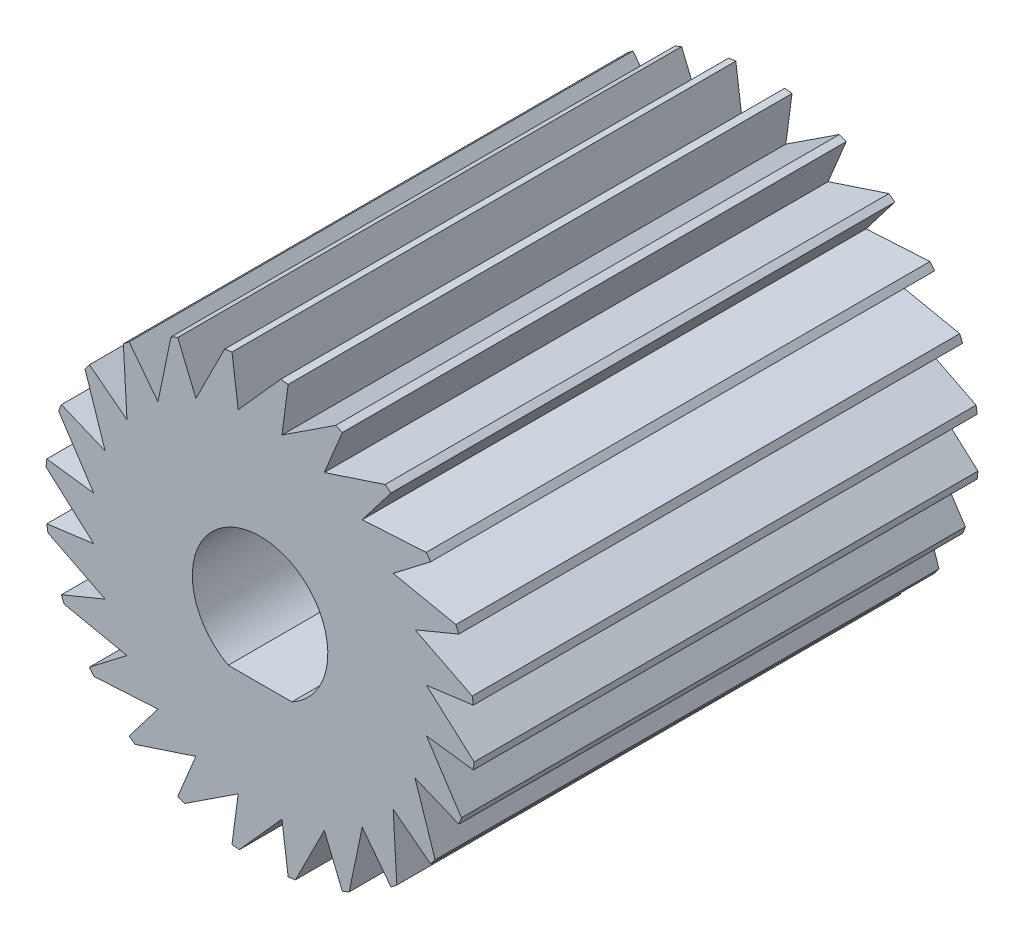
ISO-10303-21;
HEADER;
FILE_DESCRIPTION(('STEP AP214'),'2;1');
FILE_NAME('part.step','',(''),(''),'','','');
FILE_SCHEMA(('AUTOMOTIVE_DESIGN { 1 0 10303 214 1 1 1 1 }'));
ENDSEC;
DATA;
#1=APPLICATION_CONTEXT('core data for automotive mechanical design processes');
#2=APPLICATION_PROTOCOL_DEFINITION('international standard','automotive_design',2000,#1);
#3=PRODUCT_CONTEXT('',#1,'mechanical');
#4=PRODUCT('Part','Part','',(#3));
#5=PRODUCT_RELATED_PRODUCT_CATEGORY('part','',(#4));
#6=PRODUCT_DEFINITION_FORMATION('','',#4);
#7=PRODUCT_DEFINITION_CONTEXT('part definition',#1,'design');
#8=PRODUCT_DEFINITION('design','',#6,#7);
#9=PRODUCT_DEFINITION_SHAPE('','',#8);
#10=(LENGTH_UNIT() NAMED_UNIT(*) SI_UNIT(.MILLI.,.METRE.));
#11=(NAMED_UNIT(*) PLANE_ANGLE_UNIT() SI_UNIT($,.RADIAN.));
#12=(NAMED_UNIT(*) SI_UNIT($,.STERADIAN.) SOLID_ANGLE_UNIT());
#13=UNCERTAINTY_MEASURE_WITH_UNIT(LENGTH_MEASURE(1.E-05),#10,'distance_accuracy_value','');
#14=(GEOMETRIC_REPRESENTATION_CONTEXT(3) GLOBAL_UNCERTAINTY_ASSIGNED_CONTEXT((#13)) GLOBAL_UNIT_ASSIGNED_CONTEXT((#10,
#11,#12)) REPRESENTATION_CONTEXT('',''));
#15=CARTESIAN_POINT('',(0.,0.,0.));
#16=DIRECTION('',(0.,0.,1.));
#17=DIRECTION('',(1.,0.,0.));
#18=AXIS2_PLACEMENT_3D('',#15,#16,#17);
#19=CARTESIAN_POINT('',(0.,0.,-1.905));
#20=DIRECTION('',(0.,0.,1.));
#21=DIRECTION('',(1.,0.,0.));
#22=AXIS2_PLACEMENT_3D('',#19,#20,#21);
#23=PLANE('',#22);
#24=DIRECTION('',(0.991444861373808,0.130526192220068,0.));
#25=VECTOR('',#24,1.);
#26=CARTESIAN_POINT('',(5.2883668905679,0.696226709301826,-1.905));
#27=LINE('',#26,#25);
#28=CARTESIAN_POINT('',(3.92850111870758,0.517196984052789,-1.905));
#29=VERTEX_POINT('',#28);
#30=CARTESIAN_POINT('',(5.03653989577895,0.663073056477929,-1.905));
#31=VERTEX_POINT('',#30);
#32=EDGE_CURVE('E1030',#29,#31,#27,.T.);
#33=ORIENTED_EDGE('',*,*,#32,.T.);
#34=CARTESIAN_POINT('',(0.,0.,-1.905));
#35=DIRECTION('',(0.,0.,1.));
#36=DIRECTION('',(1.,0.,0.));
#37=AXIS2_PLACEMENT_3D('',#34,#35,#36);
#38=CIRCLE('',#37,5.08);
#39=CARTESIAN_POINT('',(5.01071708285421,0.836130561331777,-1.905));
#40=VERTEX_POINT('',#39);
#41=EDGE_CURVE('E817',#31,#40,#38,.T.);
#42=ORIENTED_EDGE('',*,*,#41,.T.);
#43=DIRECTION('',(-0.893034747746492,0.449987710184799,0.));
#44=VECTOR('',#43,1.);
#45=CARTESIAN_POINT('',(3.6607802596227,1.51634483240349,-1.905));
#46=LINE('',#45,#44);
#47=CARTESIAN_POINT('',(3.6607802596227,1.51634483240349,-1.905));
#48=VERTEX_POINT('',#47);
#49=EDGE_CURVE('E1031',#40,#48,#46,.T.);
#50=ORIENTED_EDGE('',*,*,#49,.T.);
#51=DIRECTION('',(0.92387953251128,0.382683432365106,0.));
#52=VECTOR('',#51,1.);
#53=CARTESIAN_POINT('',(4.92797342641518,2.04123342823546,-1.905));
#54=LINE('',#53,#52);
#55=CARTESIAN_POINT('',(4.69330802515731,1.94403183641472,-1.905));
#56=VERTEX_POINT('',#55);
#57=EDGE_CURVE('E1019',#48,#56,#54,.T.);
#58=ORIENTED_EDGE('',*,*,#57,.T.);
#59=CARTESIAN_POINT('',(4.62357452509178,2.10450911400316,-1.905));
#60=VERTEX_POINT('',#59);
#61=EDGE_CURVE('E822',#56,#60,#38,.T.);
#62=ORIENTED_EDGE('',*,*,#61,.T.);
#63=DIRECTION('',(-0.97907071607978,0.20352035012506,0.));
#64=VECTOR('',#63,1.);
#65=CARTESIAN_POINT('',(3.14358327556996,2.41215628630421,-1.905));
#66=LINE('',#65,#64);
#67=CARTESIAN_POINT('',(3.14358327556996,2.41215628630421,-1.905));
#68=VERTEX_POINT('',#67);
#69=EDGE_CURVE('E1020',#60,#68,#66,.T.);
#70=ORIENTED_EDGE('',*,*,#69,.T.);
#71=DIRECTION('',(0.793353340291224,0.608761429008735,0.));
#72=VECTOR('',#71,1.);
#73=CARTESIAN_POINT('',(4.23174671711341,3.24713346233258,-1.905));
#74=LINE('',#73,#72);
#75=CARTESIAN_POINT('',(4.03023496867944,3.09250805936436,-1.905));
#76=VERTEX_POINT('',#75);
#77=EDGE_CURVE('E1008',#68,#76,#74,.T.);
#78=ORIENTED_EDGE('',*,*,#77,.T.);
#79=CARTESIAN_POINT('',(3.92134300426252,3.22946884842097,-1.905));
#80=VERTEX_POINT('',#79);
#81=EDGE_CURVE('E1269',#76,#80,#38,.T.);
#82=ORIENTED_EDGE('',*,*,#81,.T.);
#83=DIRECTION('',(-0.99838463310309,-0.0568165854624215,0.));
#84=VECTOR('',#83,1.);
#85=CARTESIAN_POINT('',(2.41215628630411,3.14358327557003,-1.905));
#86=LINE('',#85,#84);
#87=CARTESIAN_POINT('',(2.41215628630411,3.14358327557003,-1.905));
#88=VERTEX_POINT('',#87);
#89=EDGE_CURVE('E1009',#80,#88,#86,.T.);
#90=ORIENTED_EDGE('',*,*,#89,.T.);
#91=DIRECTION('',(0.608761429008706,0.793353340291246,0.));
#92=VECTOR('',#91,1.);
#93=CARTESIAN_POINT('',(3.24713346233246,4.2317467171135,-1.905));
#94=LINE('',#93,#92);
#95=CARTESIAN_POINT('',(3.09250805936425,4.03023496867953,-1.905));
#96=VERTEX_POINT('',#95);
#97=EDGE_CURVE('E997',#88,#96,#94,.T.);
#98=ORIENTED_EDGE('',*,*,#97,.T.);
#99=CARTESIAN_POINT('',(2.95187843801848,4.13434561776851,-1.905));
#100=VERTEX_POINT('',#99);
#101=EDGE_CURVE('E1265',#96,#100,#38,.T.);
#102=ORIENTED_EDGE('',*,*,#101,.T.);
#103=DIRECTION('',(-0.949660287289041,-0.313281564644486,0.));
#104=VECTOR('',#103,1.);
#105=CARTESIAN_POINT('',(1.51634483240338,3.66078025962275,-1.905));
#106=LINE('',#105,#104);
#107=CARTESIAN_POINT('',(1.51634483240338,3.66078025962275,-1.905));
#108=VERTEX_POINT('',#107);
#109=EDGE_CURVE('E998',#100,#108,#106,.T.);
#110=ORIENTED_EDGE('',*,*,#109,.T.);
#111=DIRECTION('',(0.382683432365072,0.923879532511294,0.));
#112=VECTOR('',#111,1.);
#113=CARTESIAN_POINT('',(2.04123342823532,4.92797342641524,-1.905));
#114=LINE('',#113,#112);
#115=CARTESIAN_POINT('',(1.94403183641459,4.69330802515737,-1.905));
#116=VERTEX_POINT('',#115);
#117=EDGE_CURVE('E986',#108,#116,#114,.T.);
#118=ORIENTED_EDGE('',*,*,#117,.T.);
#119=CARTESIAN_POINT('',(1.78124823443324,4.7574735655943,-1.905));
#120=VERTEX_POINT('',#119);
#121=EDGE_CURVE('E1261',#116,#120,#38,.T.);
#122=ORIENTED_EDGE('',*,*,#121,.T.);
#123=DIRECTION('',(-0.836218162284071,-0.548396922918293,0.));
#124=VECTOR('',#123,1.);
#125=CARTESIAN_POINT('',(0.517196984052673,3.9285011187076,-1.905));
#126=LINE('',#125,#124);
#127=CARTESIAN_POINT('',(0.517196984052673,3.9285011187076,-1.905));
#128=VERTEX_POINT('',#127);
#129=EDGE_CURVE('E987',#120,#128,#126,.T.);
#130=ORIENTED_EDGE('',*,*,#129,.T.);
#131=DIRECTION('',(0.130526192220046,0.991444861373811,0.));
#132=VECTOR('',#131,1.);
#133=CARTESIAN_POINT('',(0.696226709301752,5.28836689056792,-1.905));
#134=LINE('',#133,#132);
#135=CARTESIAN_POINT('',(0.663073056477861,5.03653989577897,-1.905));
#136=VERTEX_POINT('',#135);
#137=EDGE_CURVE('E1235',#128,#136,#134,.T.);
#138=ORIENTED_EDGE('',*,*,#137,.T.);
#139=CARTESIAN_POINT('',(0.489228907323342,5.05638755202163,-1.905));
#140=VERTEX_POINT('',#139);
#141=EDGE_CURVE('E1258',#136,#140,#38,.T.);
#142=ORIENTED_EDGE('',*,*,#141,.T.);
#143=DIRECTION('',(-0.665789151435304,-0.746139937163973,0.));
#144=VECTOR('',#143,1.);
#145=CARTESIAN_POINT('',(-0.517196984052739,3.9285011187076,-1.905));
#146=LINE('',#145,#144);
#147=CARTESIAN_POINT('',(-0.517196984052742,3.9285011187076,-1.905));
#148=VERTEX_POINT('',#147);
#149=EDGE_CURVE('E1239',#140,#148,#146,.T.);
#150=ORIENTED_EDGE('',*,*,#149,.T.);
#151=DIRECTION('',(-0.130526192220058,0.991444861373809,0.));
#152=VECTOR('',#151,1.);
#153=CARTESIAN_POINT('',(-0.696226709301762,5.28836689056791,-1.905));
#154=LINE('',#153,#152);
#155=CARTESIAN_POINT('',(-0.663073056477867,5.03653989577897,-1.905));
#156=VERTEX_POINT('',#155);
#157=EDGE_CURVE('E1221',#148,#156,#154,.T.);
#158=ORIENTED_EDGE('',*,*,#157,.T.);
#159=CARTESIAN_POINT('',(-0.836130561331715,5.01071708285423,-1.905));
#160=VERTEX_POINT('',#159);
#161=EDGE_CURVE('E1270',#156,#160,#38,.T.);
#162=ORIENTED_EDGE('',*,*,#161,.T.);
#163=DIRECTION('',(-0.449987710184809,-0.893034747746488,0.));
#164=VECTOR('',#163,1.);
#165=CARTESIAN_POINT('',(-1.51634483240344,3.66078025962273,-1.905));
#166=LINE('',#165,#164);
#167=CARTESIAN_POINT('',(-1.51634483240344,3.66078025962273,-1.905));
#168=VERTEX_POINT('',#167);
#169=EDGE_CURVE('E1228',#160,#168,#166,.T.);
#170=ORIENTED_EDGE('',*,*,#169,.T.);
#171=DIRECTION('',(-0.382683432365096,0.923879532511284,0.));
#172=VECTOR('',#171,1.);
#173=CARTESIAN_POINT('',(-2.0412334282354,4.92797342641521,-1.905));
#174=LINE('',#173,#172);
#175=CARTESIAN_POINT('',(-1.94403183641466,4.69330802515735,-1.905));
#176=VERTEX_POINT('',#175);
#177=EDGE_CURVE('E1217',#168,#176,#174,.T.);
#178=ORIENTED_EDGE('',*,*,#177,.T.);
#179=CARTESIAN_POINT('',(-2.1045091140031,4.62357452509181,-1.905));
#180=VERTEX_POINT('',#179);
#181=EDGE_CURVE('E1273',#176,#180,#38,.T.);
#182=ORIENTED_EDGE('',*,*,#181,.T.);
#183=DIRECTION('',(-0.20352035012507,-0.979070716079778,0.));
#184=VECTOR('',#183,1.);
#185=CARTESIAN_POINT('',(-2.41215628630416,3.14358327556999,-1.905));
#186=LINE('',#185,#184);
#187=CARTESIAN_POINT('',(-2.41215628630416,3.14358327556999,-1.905));
#188=VERTEX_POINT('',#187);
#189=EDGE_CURVE('E1218',#180,#188,#186,.T.);
#190=ORIENTED_EDGE('',*,*,#189,.T.);
#191=DIRECTION('',(-0.608761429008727,0.793353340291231,0.));
#192=VECTOR('',#191,1.);
#193=CARTESIAN_POINT('',(-3.24713346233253,4.23174671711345,-1.905));
#194=LINE('',#193,#192);
#195=CARTESIAN_POINT('',(-3.09250805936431,4.03023496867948,-1.905));
#196=VERTEX_POINT('',#195);
#197=EDGE_CURVE('E1206',#188,#196,#194,.T.);
#198=ORIENTED_EDGE('',*,*,#197,.T.);
#199=CARTESIAN_POINT('',(-3.22946884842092,3.92134300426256,-1.905));
#200=VERTEX_POINT('',#199);
#201=EDGE_CURVE('E1277',#196,#200,#38,.T.);
#202=ORIENTED_EDGE('',*,*,#201,.T.);
#203=DIRECTION('',(0.0568165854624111,-0.998384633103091,0.));
#204=VECTOR('',#203,1.);
#205=CARTESIAN_POINT('',(-3.14358327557,2.41215628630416,-1.905));
#206=LINE('',#205,#204);
#207=CARTESIAN_POINT('',(-3.14358327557,2.41215628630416,-1.905));
#208=VERTEX_POINT('',#207);
#209=EDGE_CURVE('E1207',#200,#208,#206,.T.);
#210=ORIENTED_EDGE('',*,*,#209,.T.);
#211=DIRECTION('',(-0.79335334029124,0.608761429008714,0.));
#212=VECTOR('',#211,1.);
#213=CARTESIAN_POINT('',(-4.23174671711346,3.24713346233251,-1.905));
#214=LINE('',#213,#212);
#215=CARTESIAN_POINT('',(-4.03023496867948,3.0925080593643,-1.905));
#216=VERTEX_POINT('',#215);
#217=EDGE_CURVE('E1195',#208,#216,#214,.T.);
#218=ORIENTED_EDGE('',*,*,#217,.T.);
#219=CARTESIAN_POINT('',(-4.13434561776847,2.95187843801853,-1.905));
#220=VERTEX_POINT('',#219);
#221=EDGE_CURVE('E1281',#216,#220,#38,.T.);
#222=ORIENTED_EDGE('',*,*,#221,.T.);
#223=DIRECTION('',(0.313281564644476,-0.949660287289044,0.));
#224=VECTOR('',#223,1.);
#225=CARTESIAN_POINT('',(-3.66078025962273,1.51634483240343,-1.905));
#226=LINE('',#225,#224);
#227=CARTESIAN_POINT('',(-3.66078025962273,1.51634483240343,-1.905));
#228=VERTEX_POINT('',#227);
#229=EDGE_CURVE('E1196',#220,#228,#226,.T.);
#230=ORIENTED_EDGE('',*,*,#229,.T.);
#231=DIRECTION('',(-0.92387953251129,0.382683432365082,0.));
#232=VECTOR('',#231,1.);
#233=CARTESIAN_POINT('',(-4.92797342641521,2.04123342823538,-1.905));
#234=LINE('',#233,#232);
#235=CARTESIAN_POINT('',(-4.69330802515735,1.94403183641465,-1.905));
#236=VERTEX_POINT('',#235);
#237=EDGE_CURVE('E1184',#228,#236,#234,.T.);
#238=ORIENTED_EDGE('',*,*,#237,.T.);
#239=CARTESIAN_POINT('',(-4.75747356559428,1.7812482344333,-1.905));
#240=VERTEX_POINT('',#239);
#241=EDGE_CURVE('E1285',#236,#240,#38,.T.);
#242=ORIENTED_EDGE('',*,*,#241,.T.);
#243=DIRECTION('',(0.548396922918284,-0.836218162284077,0.));
#244=VECTOR('',#243,1.);
#245=CARTESIAN_POINT('',(-3.92850111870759,0.517196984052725,-1.905));
#246=LINE('',#245,#244);
#247=CARTESIAN_POINT('',(-3.92850111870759,0.517196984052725,-1.905));
#248=VERTEX_POINT('',#247);
#249=EDGE_CURVE('E1185',#240,#248,#246,.T.);
#250=ORIENTED_EDGE('',*,*,#249,.T.);
#251=DIRECTION('',(-0.991444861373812,0.130526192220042,0.));
#252=VECTOR('',#251,1.);
#253=CARTESIAN_POINT('',(-5.28836689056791,0.696226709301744,-1.905));
#254=LINE('',#253,#252);
#255=CARTESIAN_POINT('',(-5.03653989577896,0.663073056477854,-1.905));
#256=VERTEX_POINT('',#255);
#257=EDGE_CURVE('E1173',#248,#256,#254,.T.);
#258=ORIENTED_EDGE('',*,*,#257,.T.);
#259=CARTESIAN_POINT('',(-5.05638755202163,0.489228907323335,-1.905));
#260=VERTEX_POINT('',#259);
#261=EDGE_CURVE('E1289',#256,#260,#38,.T.);
#262=ORIENTED_EDGE('',*,*,#261,.T.);
#263=DIRECTION('',(0.746139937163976,-0.665789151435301,0.));
#264=VECTOR('',#263,1.);
#265=CARTESIAN_POINT('',(-3.92850111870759,-0.517196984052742,-1.905));
#266=LINE('',#265,#264);
#267=CARTESIAN_POINT('',(-3.92850111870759,-0.517196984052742,-1.905));
#268=VERTEX_POINT('',#267);
#269=EDGE_CURVE('E1174',#260,#268,#266,.T.);
#270=ORIENTED_EDGE('',*,*,#269,.T.);
#271=DIRECTION('',(-0.991444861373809,-0.130526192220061,0.));
#272=VECTOR('',#271,1.);
#273=CARTESIAN_POINT('',(-5.2883668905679,-0.696226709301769,-1.905));
#274=LINE('',#273,#272);
#275=CARTESIAN_POINT('',(-5.03653989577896,-0.663073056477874,-1.905));
#276=VERTEX_POINT('',#275);
#277=EDGE_CURVE('E1162',#268,#276,#274,.T.);
#278=ORIENTED_EDGE('',*,*,#277,.T.);
#279=CARTESIAN_POINT('',(-5.01071708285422,-0.836130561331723,-1.905));
#280=VERTEX_POINT('',#279);
#281=EDGE_CURVE('E1293',#276,#280,#38,.T.);
#282=ORIENTED_EDGE('',*,*,#281,.T.);
#283=DIRECTION('',(0.893034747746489,-0.449987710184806,0.));
#284=VECTOR('',#283,1.);
#285=CARTESIAN_POINT('',(-3.66078025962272,-1.51634483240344,-1.905));
#286=LINE('',#285,#284);
#287=CARTESIAN_POINT('',(-3.66078025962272,-1.51634483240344,-1.905));
#288=VERTEX_POINT('',#287);
#289=EDGE_CURVE('E1163',#280,#288,#286,.T.);
#290=ORIENTED_EDGE('',*,*,#289,.T.);
#291=DIRECTION('',(-0.923879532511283,-0.382683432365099,0.));
#292=VECTOR('',#291,1.);
#293=CARTESIAN_POINT('',(-4.9279734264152,-2.0412334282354,-1.905));
#294=LINE('',#293,#292);
#295=CARTESIAN_POINT('',(-4.69330802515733,-1.94403183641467,-1.905));
#296=VERTEX_POINT('',#295);
#297=EDGE_CURVE('E1151',#288,#296,#294,.T.);
#298=ORIENTED_EDGE('',*,*,#297,.T.);
#299=CARTESIAN_POINT('',(-4.6235745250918,-2.10450911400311,-1.905));
#300=VERTEX_POINT('',#299);
#301=EDGE_CURVE('E1297',#296,#300,#38,.T.);
#302=ORIENTED_EDGE('',*,*,#301,.T.);
#303=DIRECTION('',(0.979070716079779,-0.203520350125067,0.));
#304=VECTOR('',#303,1.);
#305=CARTESIAN_POINT('',(-3.14358327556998,-2.41215628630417,-1.905));
#306=LINE('',#305,#304);
#307=CARTESIAN_POINT('',(-3.14358327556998,-2.41215628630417,-1.905));
#308=VERTEX_POINT('',#307);
#309=EDGE_CURVE('E1152',#300,#308,#306,.T.);
#310=ORIENTED_EDGE('',*,*,#309,.T.);
#311=DIRECTION('',(-0.793353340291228,-0.608761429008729,0.));
#312=VECTOR('',#311,1.);
#313=CARTESIAN_POINT('',(-4.23174671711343,-3.24713346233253,-1.905));
#314=LINE('',#313,#312);
#315=CARTESIAN_POINT('',(-4.03023496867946,-3.09250805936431,-1.905));
#316=VERTEX_POINT('',#315);
#317=EDGE_CURVE('E1140',#308,#316,#314,.T.);
#318=ORIENTED_EDGE('',*,*,#317,.T.);
#319=CARTESIAN_POINT('',(-3.92134300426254,-3.22946884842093,-1.905));
#320=VERTEX_POINT('',#319);
#321=EDGE_CURVE('E1301',#316,#320,#38,.T.);
#322=ORIENTED_EDGE('',*,*,#321,.T.);
#323=DIRECTION('',(0.99838463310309,0.0568165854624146,0.));
#324=VECTOR('',#323,1.);
#325=CARTESIAN_POINT('',(-2.41215628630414,-3.14358327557,-1.905));
#326=LINE('',#325,#324);
#327=CARTESIAN_POINT('',(-2.41215628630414,-3.14358327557,-1.905));
#328=VERTEX_POINT('',#327);
#329=EDGE_CURVE('E1141',#320,#328,#326,.T.);
#330=ORIENTED_EDGE('',*,*,#329,.T.);
#331=DIRECTION('',(-0.608761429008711,-0.793353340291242,0.));
#332=VECTOR('',#331,1.);
#333=CARTESIAN_POINT('',(-3.24713346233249,-4.23174671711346,-1.905));
#334=LINE('',#333,#332);
#335=CARTESIAN_POINT('',(-3.09250805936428,-4.03023496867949,-1.905));
#336=VERTEX_POINT('',#335);
#337=EDGE_CURVE('E1129',#328,#336,#334,.T.);
#338=ORIENTED_EDGE('',*,*,#337,.T.);
#339=CARTESIAN_POINT('',(-2.95187843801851,-4.13434561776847,-1.905));
#340=VERTEX_POINT('',#339);
#341=EDGE_CURVE('E1305',#336,#340,#38,.T.);
#342=ORIENTED_EDGE('',*,*,#341,.T.);
#343=DIRECTION('',(0.949660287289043,0.313281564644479,0.));
#344=VECTOR('',#343,1.);
#345=CARTESIAN_POINT('',(-1.51634483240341,-3.66078025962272,-1.905));
#346=LINE('',#345,#344);
#347=CARTESIAN_POINT('',(-1.51634483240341,-3.66078025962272,-1.905));
#348=VERTEX_POINT('',#347);
#349=EDGE_CURVE('E1130',#340,#348,#346,.T.);
#350=ORIENTED_EDGE('',*,*,#349,.T.);
#351=DIRECTION('',(-0.382683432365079,-0.923879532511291,0.));
#352=VECTOR('',#351,1.);
#353=CARTESIAN_POINT('',(-2.04123342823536,-4.92797342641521,-1.905));
#354=LINE('',#353,#352);
#355=CARTESIAN_POINT('',(-1.94403183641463,-4.69330802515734,-1.905));
#356=VERTEX_POINT('',#355);
#357=EDGE_CURVE('E1118',#348,#356,#354,.T.);
#358=ORIENTED_EDGE('',*,*,#357,.T.);
#359=CARTESIAN_POINT('',(-1.78124823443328,-4.75747356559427,-1.905));
#360=VERTEX_POINT('',#359);
#361=EDGE_CURVE('E1309',#356,#360,#38,.T.);
#362=ORIENTED_EDGE('',*,*,#361,.T.);
#363=DIRECTION('',(0.836218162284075,0.548396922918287,0.));
#364=VECTOR('',#363,1.);
#365=CARTESIAN_POINT('',(-0.517196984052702,-3.92850111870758,-1.905));
#366=LINE('',#365,#364);
#367=CARTESIAN_POINT('',(-0.517196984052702,-3.92850111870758,-1.905));
#368=VERTEX_POINT('',#367);
#369=EDGE_CURVE('E1119',#360,#368,#366,.T.);
#370=ORIENTED_EDGE('',*,*,#369,.T.);
#371=DIRECTION('',(-0.130526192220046,-0.991444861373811,0.));
#372=VECTOR('',#371,1.);
#373=CARTESIAN_POINT('',(-0.696226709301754,-5.2883668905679,-1.905));
#374=LINE('',#373,#372);
#375=CARTESIAN_POINT('',(-0.663073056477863,-5.03653989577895,-1.905));
#376=VERTEX_POINT('',#375);
#377=EDGE_CURVE('E1107',#368,#376,#374,.T.);
#378=ORIENTED_EDGE('',*,*,#377,.T.);
#379=CARTESIAN_POINT('',(-0.489228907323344,-5.05638755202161,-1.905));
#380=VERTEX_POINT('',#379);
#381=EDGE_CURVE('E1313',#376,#380,#38,.T.);
#382=ORIENTED_EDGE('',*,*,#381,.T.);
#383=DIRECTION('',(0.665789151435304,0.746139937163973,0.));
#384=VECTOR('',#383,1.);
#385=CARTESIAN_POINT('',(0.517196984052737,-3.92850111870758,-1.905));
#386=LINE('',#385,#384);
#387=CARTESIAN_POINT('',(0.517196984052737,-3.92850111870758,-1.905));
#388=VERTEX_POINT('',#387);
#389=EDGE_CURVE('E1108',#380,#388,#386,.T.);
#390=ORIENTED_EDGE('',*,*,#389,.T.);
#391=DIRECTION('',(0.130526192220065,-0.991444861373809,0.));
#392=VECTOR('',#391,1.);
#393=CARTESIAN_POINT('',(0.696226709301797,-5.28836689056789,-1.905));
#394=LINE('',#393,#392);
#395=CARTESIAN_POINT('',(0.6630730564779,-5.03653989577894,-1.905));
#396=VERTEX_POINT('',#395);
#397=EDGE_CURVE('E1096',#388,#396,#394,.T.);
#398=ORIENTED_EDGE('',*,*,#397,.T.);
#399=CARTESIAN_POINT('',(0.836130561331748,-5.01071708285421,-1.905));
#400=VERTEX_POINT('',#399);
#401=EDGE_CURVE('E1317',#396,#400,#38,.T.);
#402=ORIENTED_EDGE('',*,*,#401,.T.);
#403=DIRECTION('',(0.449987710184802,0.893034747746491,0.));
#404=VECTOR('',#403,1.);
#405=CARTESIAN_POINT('',(1.51634483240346,-3.6607802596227,-1.905));
#406=LINE('',#405,#404);
#407=CARTESIAN_POINT('',(1.51634483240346,-3.6607802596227,-1.905));
#408=VERTEX_POINT('',#407);
#409=EDGE_CURVE('E1097',#400,#408,#406,.T.);
#410=ORIENTED_EDGE('',*,*,#409,.T.);
#411=DIRECTION('',(0.382683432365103,-0.923879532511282,0.));
#412=VECTOR('',#411,1.);
#413=CARTESIAN_POINT('',(2.04123342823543,-4.92797342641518,-1.905));
#414=LINE('',#413,#412);
#415=CARTESIAN_POINT('',(1.94403183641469,-4.69330802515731,-1.905));
#416=VERTEX_POINT('',#415);
#417=EDGE_CURVE('E1085',#408,#416,#414,.T.);
#418=ORIENTED_EDGE('',*,*,#417,.T.);
#419=CARTESIAN_POINT('',(2.10450911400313,-4.62357452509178,-1.905));
#420=VERTEX_POINT('',#419);
#421=EDGE_CURVE('E1321',#416,#420,#38,.T.);
#422=ORIENTED_EDGE('',*,*,#421,.T.);
#423=DIRECTION('',(0.203520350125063,0.979070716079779,0.));
#424=VECTOR('',#423,1.);
#425=CARTESIAN_POINT('',(2.41215628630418,-3.14358327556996,-1.905));
#426=LINE('',#425,#424);
#427=CARTESIAN_POINT('',(2.41215628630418,-3.14358327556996,-1.905));
#428=VERTEX_POINT('',#427);
#429=EDGE_CURVE('E1086',#420,#428,#426,.T.);
#430=ORIENTED_EDGE('',*,*,#429,.T.);
#431=DIRECTION('',(0.608761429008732,-0.793353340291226,0.));
#432=VECTOR('',#431,1.);
#433=CARTESIAN_POINT('',(3.24713346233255,-4.23174671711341,-1.905));
#434=LINE('',#433,#432);
#435=CARTESIAN_POINT('',(3.09250805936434,-4.03023496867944,-1.905));
#436=VERTEX_POINT('',#435);
#437=EDGE_CURVE('E1074',#428,#436,#434,.T.);
#438=ORIENTED_EDGE('',*,*,#437,.T.);
#439=CARTESIAN_POINT('',(3.22946884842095,-3.92134300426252,-1.905));
#440=VERTEX_POINT('',#439);
#441=EDGE_CURVE('E1325',#436,#440,#38,.T.);
#442=ORIENTED_EDGE('',*,*,#441,.T.);
#443=DIRECTION('',(-0.056816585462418,0.99838463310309,0.));
#444=VECTOR('',#443,1.);
#445=CARTESIAN_POINT('',(3.14358327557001,-2.41215628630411,-1.905));
#446=LINE('',#445,#444);
#447=CARTESIAN_POINT('',(3.14358327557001,-2.41215628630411,-1.905));
#448=VERTEX_POINT('',#447);
#449=EDGE_CURVE('E1075',#440,#448,#446,.T.);
#450=ORIENTED_EDGE('',*,*,#449,.T.);
#451=DIRECTION('',(0.793353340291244,-0.608761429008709,0.));
#452=VECTOR('',#451,1.);
#453=CARTESIAN_POINT('',(4.23174671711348,-3.24713346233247,-1.905));
#454=LINE('',#453,#452);
#455=CARTESIAN_POINT('',(4.0302349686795,-3.09250805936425,-1.905));
#456=VERTEX_POINT('',#455);
#457=EDGE_CURVE('E1063',#448,#456,#454,.T.);
#458=ORIENTED_EDGE('',*,*,#457,.T.);
#459=CARTESIAN_POINT('',(4.13434561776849,-2.95187843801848,-1.905));
#460=VERTEX_POINT('',#459);
#461=EDGE_CURVE('E1329',#456,#460,#38,.T.);
#462=ORIENTED_EDGE('',*,*,#461,.T.);
#463=DIRECTION('',(-0.313281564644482,0.949660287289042,0.));
#464=VECTOR('',#463,1.);
#465=CARTESIAN_POINT('',(3.66078025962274,-1.51634483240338,-1.905));
#466=LINE('',#465,#464);
#467=CARTESIAN_POINT('',(3.66078025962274,-1.51634483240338,-1.905));
#468=VERTEX_POINT('',#467);
#469=EDGE_CURVE('E1064',#460,#468,#466,.T.);
#470=ORIENTED_EDGE('',*,*,#469,.T.);
#471=DIRECTION('',(0.923879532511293,-0.382683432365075,0.));
#472=VECTOR('',#471,1.);
#473=CARTESIAN_POINT('',(4.92797342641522,-2.04123342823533,-1.905));
#474=LINE('',#473,#472);
#475=CARTESIAN_POINT('',(4.69330802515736,-1.9440318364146,-1.905));
#476=VERTEX_POINT('',#475);
#477=EDGE_CURVE('E1052',#468,#476,#474,.T.);
#478=ORIENTED_EDGE('',*,*,#477,.T.);
#479=CARTESIAN_POINT('',(4.75747356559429,-1.78124823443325,-1.905));
#480=VERTEX_POINT('',#479);
#481=EDGE_CURVE('E1333',#476,#480,#38,.T.);
#482=ORIENTED_EDGE('',*,*,#481,.T.);
#483=DIRECTION('',(-0.54839692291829,0.836218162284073,0.));
#484=VECTOR('',#483,1.);
#485=CARTESIAN_POINT('',(3.92850111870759,-0.517196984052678,-1.905));
#486=LINE('',#485,#484);
#487=CARTESIAN_POINT('',(3.92850111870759,-0.517196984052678,-1.905));
#488=VERTEX_POINT('',#487);
#489=EDGE_CURVE('E1053',#480,#488,#486,.T.);
#490=ORIENTED_EDGE('',*,*,#489,.T.);
#491=DIRECTION('',(0.991444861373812,-0.130526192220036,0.));
#492=VECTOR('',#491,1.);
#493=CARTESIAN_POINT('',(5.28836689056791,-0.696226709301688,-1.905));
#494=LINE('',#493,#492);
#495=CARTESIAN_POINT('',(5.03653989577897,-0.663073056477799,-1.905));
#496=VERTEX_POINT('',#495);
#497=EDGE_CURVE('E1041',#488,#496,#494,.T.);
#498=ORIENTED_EDGE('',*,*,#497,.T.);
#499=CARTESIAN_POINT('',(5.05638755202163,-0.48922890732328,-1.905));
#500=VERTEX_POINT('',#499);
#501=EDGE_CURVE('E816',#496,#500,#38,.T.);
#502=ORIENTED_EDGE('',*,*,#501,.T.);
#503=DIRECTION('',(-0.74613993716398,0.665789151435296,0.));
#504=VECTOR('',#503,1.);
#505=CARTESIAN_POINT('',(3.92850111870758,0.517196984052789,-1.905));
#506=LINE('',#505,#504);
#507=EDGE_CURVE('E1042',#500,#29,#506,.T.);
#508=ORIENTED_EDGE('',*,*,#507,.T.);
#509=EDGE_LOOP('',(#33,#42,#50,#58,#62,#70,#78,#82,#90,#98,#102,#110,#118,#122,#130,#138,#142,
#150,#158,#162,#170,#178,#182,#190,#198,#202,#210,#218,#222,#230,#238,#242,#250,#258,#262,#270,
#278,#282,#290,#298,#302,#310,#318,#322,#330,#338,#342,#350,#358,#362,#370,#378,#382,#390,#398,
#402,#410,#418,#422,#430,#438,#442,#450,#458,#462,#470,#478,#482,#490,#498,#502,#508));
#510=FACE_BOUND('',#509,.T.);
#511=CARTESIAN_POINT('',(0.,0.,-1.905));
#512=DIRECTION('',(0.,0.,1.));
#513=DIRECTION('',(1.,0.,0.));
#514=AXIS2_PLACEMENT_3D('',#511,#512,#513);
#515=CIRCLE('',#514,1.6);
#516=CARTESIAN_POINT('',(0.75,-1.41332940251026,-1.905));
#517=VERTEX_POINT('',#516);
#518=CARTESIAN_POINT('',(-0.75,-1.41332940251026,-1.905));
#519=VERTEX_POINT('',#518);
#520=EDGE_CURVE('E519',#517,#519,#515,.T.);
#521=ORIENTED_EDGE('',*,*,#520,.F.);
#522=DIRECTION('',(-1.,0.,0.));
#523=VECTOR('',#522,1.);
#524=CARTESIAN_POINT('',(0.,-1.41332940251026,-1.905));
#525=LINE('',#524,#523);
#526=EDGE_CURVE('E60',#517,#519,#525,.T.);
#527=ORIENTED_EDGE('',*,*,#526,.T.);
#528=EDGE_LOOP('',(#521,#527));
#529=FACE_BOUND('',#528,.T.);
#530=ADVANCED_FACE('F45',(#510,#529),#23,.T.);
#531=CARTESIAN_POINT('',(0.,0.,-13.805));
#532=DIRECTION('',(0.,0.,1.));
#533=DIRECTION('',(1.,0.,0.));
#534=AXIS2_PLACEMENT_3D('',#531,#532,#533);
#535=PLANE('',#534);
#536=DIRECTION('',(-0.746139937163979,0.665789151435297,0.));
#537=VECTOR('',#536,1.);
#538=CARTESIAN_POINT('',(5.05638755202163,-0.489228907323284,-13.805));
#539=LINE('',#538,#537);
#540=CARTESIAN_POINT('',(5.05638755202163,-0.489228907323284,-13.805));
#541=VERTEX_POINT('',#540);
#542=CARTESIAN_POINT('',(3.92850111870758,0.517196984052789,-13.805));
#543=VERTEX_POINT('',#542);
#544=EDGE_CURVE('E527',#541,#543,#539,.T.);
#545=ORIENTED_EDGE('',*,*,#544,.F.);
#546=CARTESIAN_POINT('',(0.,0.,-13.805));
#547=DIRECTION('',(0.,0.,1.));
#548=DIRECTION('',(1.,0.,0.));
#549=AXIS2_PLACEMENT_3D('',#546,#547,#548);
#550=CIRCLE('',#549,5.08);
#551=CARTESIAN_POINT('',(5.03653989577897,-0.663073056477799,-13.805));
#552=VERTEX_POINT('',#551);
#553=EDGE_CURVE('E812',#552,#541,#550,.T.);
#554=ORIENTED_EDGE('',*,*,#553,.F.);
#555=DIRECTION('',(0.991444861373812,-0.130526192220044,0.));
#556=VECTOR('',#555,1.);
#557=CARTESIAN_POINT('',(3.92850111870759,-0.517196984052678,-13.805));
#558=LINE('',#557,#556);
#559=CARTESIAN_POINT('',(3.92850111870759,-0.517196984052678,-13.805));
#560=VERTEX_POINT('',#559);
#561=EDGE_CURVE('E808',#560,#552,#558,.T.);
#562=ORIENTED_EDGE('',*,*,#561,.F.);
#563=DIRECTION('',(-0.548396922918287,0.836218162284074,0.));
#564=VECTOR('',#563,1.);
#565=CARTESIAN_POINT('',(4.75747356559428,-1.78124823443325,-13.805));
#566=LINE('',#565,#564);
#567=CARTESIAN_POINT('',(4.75747356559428,-1.78124823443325,-13.805));
#568=VERTEX_POINT('',#567);
#569=EDGE_CURVE('E804',#568,#560,#566,.T.);
#570=ORIENTED_EDGE('',*,*,#569,.F.);
#571=CARTESIAN_POINT('',(0.,0.,-13.805));
#572=DIRECTION('',(0.,0.,1.));
#573=DIRECTION('',(1.,0.,0.));
#574=AXIS2_PLACEMENT_3D('',#571,#572,#573);
#575=CIRCLE('',#574,5.08);
#576=CARTESIAN_POINT('',(4.69330802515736,-1.9440318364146,-13.805));
#577=VERTEX_POINT('',#576);
#578=EDGE_CURVE('E800',#577,#568,#575,.T.);
#579=ORIENTED_EDGE('',*,*,#578,.F.);
#580=DIRECTION('',(0.92387953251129,-0.382683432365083,0.));
#581=VECTOR('',#580,1.);
#582=CARTESIAN_POINT('',(3.66078025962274,-1.51634483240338,-13.805));
#583=LINE('',#582,#581);
#584=CARTESIAN_POINT('',(3.66078025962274,-1.51634483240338,-13.805));
#585=VERTEX_POINT('',#584);
#586=EDGE_CURVE('E796',#585,#577,#583,.T.);
#587=ORIENTED_EDGE('',*,*,#586,.F.);
#588=DIRECTION('',(-0.313281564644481,0.949660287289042,0.));
#589=VECTOR('',#588,1.);
#590=CARTESIAN_POINT('',(4.13434561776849,-2.95187843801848,-13.805));
#591=LINE('',#590,#589);
#592=CARTESIAN_POINT('',(4.13434561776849,-2.95187843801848,-13.805));
#593=VERTEX_POINT('',#592);
#594=EDGE_CURVE('E792',#593,#585,#591,.T.);
#595=ORIENTED_EDGE('',*,*,#594,.F.);
#596=CARTESIAN_POINT('',(0.,0.,-13.805));
#597=DIRECTION('',(0.,0.,1.));
#598=DIRECTION('',(1.,0.,0.));
#599=AXIS2_PLACEMENT_3D('',#596,#597,#598);
#600=CIRCLE('',#599,5.08);
#601=CARTESIAN_POINT('',(4.0302349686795,-3.09250805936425,-13.805));
#602=VERTEX_POINT('',#601);
#603=EDGE_CURVE('E788',#602,#593,#600,.T.);
#604=ORIENTED_EDGE('',*,*,#603,.F.);
#605=DIRECTION('',(0.793353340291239,-0.608761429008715,0.));
#606=VECTOR('',#605,1.);
#607=CARTESIAN_POINT('',(3.14358327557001,-2.41215628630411,-13.805));
#608=LINE('',#607,#606);
#609=CARTESIAN_POINT('',(3.14358327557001,-2.41215628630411,-13.805));
#610=VERTEX_POINT('',#609);
#611=EDGE_CURVE('E784',#610,#602,#608,.T.);
#612=ORIENTED_EDGE('',*,*,#611,.F.);
#613=DIRECTION('',(-0.056816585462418,0.99838463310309,0.));
#614=VECTOR('',#613,1.);
#615=CARTESIAN_POINT('',(3.22946884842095,-3.92134300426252,-13.805));
#616=LINE('',#615,#614);
#617=CARTESIAN_POINT('',(3.22946884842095,-3.92134300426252,-13.805));
#618=VERTEX_POINT('',#617);
#619=EDGE_CURVE('E780',#618,#610,#616,.T.);
#620=ORIENTED_EDGE('',*,*,#619,.F.);
#621=CARTESIAN_POINT('',(0.,0.,-13.805));
#622=DIRECTION('',(0.,0.,1.));
#623=DIRECTION('',(1.,0.,0.));
#624=AXIS2_PLACEMENT_3D('',#621,#622,#623);
#625=CIRCLE('',#624,5.08);
#626=CARTESIAN_POINT('',(3.09250805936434,-4.03023496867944,-13.805));
#627=VERTEX_POINT('',#626);
#628=EDGE_CURVE('E776',#627,#618,#625,.T.);
#629=ORIENTED_EDGE('',*,*,#628,.F.);
#630=DIRECTION('',(0.608761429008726,-0.793353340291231,0.));
#631=VECTOR('',#630,1.);
#632=CARTESIAN_POINT('',(2.41215628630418,-3.14358327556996,-13.805));
#633=LINE('',#632,#631);
#634=CARTESIAN_POINT('',(2.41215628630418,-3.14358327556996,-13.805));
#635=VERTEX_POINT('',#634);
#636=EDGE_CURVE('E772',#635,#627,#633,.T.);
#637=ORIENTED_EDGE('',*,*,#636,.F.);
#638=DIRECTION('',(0.203520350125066,0.979070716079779,0.));
#639=VECTOR('',#638,1.);
#640=CARTESIAN_POINT('',(2.10450911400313,-4.62357452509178,-13.805));
#641=LINE('',#640,#639);
#642=CARTESIAN_POINT('',(2.10450911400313,-4.62357452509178,-13.805));
#643=VERTEX_POINT('',#642);
#644=EDGE_CURVE('E768',#643,#635,#641,.T.);
#645=ORIENTED_EDGE('',*,*,#644,.F.);
#646=CARTESIAN_POINT('',(0.,0.,-13.805));
#647=DIRECTION('',(0.,0.,1.));
#648=DIRECTION('',(1.,0.,0.));
#649=AXIS2_PLACEMENT_3D('',#646,#647,#648);
#650=CIRCLE('',#649,5.08);
#651=CARTESIAN_POINT('',(1.94403183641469,-4.69330802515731,-13.805));
#652=VERTEX_POINT('',#651);
#653=EDGE_CURVE('E764',#652,#643,#650,.T.);
#654=ORIENTED_EDGE('',*,*,#653,.F.);
#655=DIRECTION('',(0.382683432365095,-0.923879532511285,0.));
#656=VECTOR('',#655,1.);
#657=CARTESIAN_POINT('',(1.51634483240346,-3.6607802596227,-13.805));
#658=LINE('',#657,#656);
#659=CARTESIAN_POINT('',(1.51634483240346,-3.6607802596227,-13.805));
#660=VERTEX_POINT('',#659);
#661=EDGE_CURVE('E760',#660,#652,#658,.T.);
#662=ORIENTED_EDGE('',*,*,#661,.F.);
#663=DIRECTION('',(0.449987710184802,0.893034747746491,0.));
#664=VECTOR('',#663,1.);
#665=CARTESIAN_POINT('',(0.836130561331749,-5.01071708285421,-13.805));
#666=LINE('',#665,#664);
#667=CARTESIAN_POINT('',(0.836130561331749,-5.01071708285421,-13.805));
#668=VERTEX_POINT('',#667);
#669=EDGE_CURVE('E756',#668,#660,#666,.T.);
#670=ORIENTED_EDGE('',*,*,#669,.F.);
#671=CARTESIAN_POINT('',(0.,0.,-13.805));
#672=DIRECTION('',(0.,0.,1.));
#673=DIRECTION('',(1.,0.,0.));
#674=AXIS2_PLACEMENT_3D('',#671,#672,#673);
#675=CIRCLE('',#674,5.08);
#676=CARTESIAN_POINT('',(0.6630730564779,-5.03653989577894,-13.805));
#677=VERTEX_POINT('',#676);
#678=EDGE_CURVE('E752',#677,#668,#675,.T.);
#679=ORIENTED_EDGE('',*,*,#678,.F.);
#680=DIRECTION('',(0.130526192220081,-0.991444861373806,0.));
#681=VECTOR('',#680,1.);
#682=CARTESIAN_POINT('',(0.517196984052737,-3.92850111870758,-13.805));
#683=LINE('',#682,#681);
#684=CARTESIAN_POINT('',(0.517196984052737,-3.92850111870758,-13.805));
#685=VERTEX_POINT('',#684);
#686=EDGE_CURVE('E748',#685,#677,#683,.T.);
#687=ORIENTED_EDGE('',*,*,#686,.F.);
#688=DIRECTION('',(0.665789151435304,0.746139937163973,0.));
#689=VECTOR('',#688,1.);
#690=CARTESIAN_POINT('',(-0.489228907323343,-5.05638755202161,-13.805));
#691=LINE('',#690,#689);
#692=CARTESIAN_POINT('',(-0.489228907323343,-5.05638755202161,-13.805));
#693=VERTEX_POINT('',#692);
#694=EDGE_CURVE('E744',#693,#685,#691,.T.);
#695=ORIENTED_EDGE('',*,*,#694,.F.);
#696=CARTESIAN_POINT('',(0.,0.,-13.805));
#697=DIRECTION('',(0.,0.,1.));
#698=DIRECTION('',(1.,0.,0.));
#699=AXIS2_PLACEMENT_3D('',#696,#697,#698);
#700=CIRCLE('',#699,5.08);
#701=CARTESIAN_POINT('',(-0.663073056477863,-5.03653989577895,-13.805));
#702=VERTEX_POINT('',#701);
#703=EDGE_CURVE('E740',#702,#693,#700,.T.);
#704=ORIENTED_EDGE('',*,*,#703,.F.);
#705=DIRECTION('',(-0.130526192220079,-0.991444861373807,0.));
#706=VECTOR('',#705,1.);
#707=CARTESIAN_POINT('',(-0.517196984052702,-3.92850111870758,-13.805));
#708=LINE('',#707,#706);
#709=CARTESIAN_POINT('',(-0.517196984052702,-3.92850111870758,-13.805));
#710=VERTEX_POINT('',#709);
#711=EDGE_CURVE('E736',#710,#702,#708,.T.);
#712=ORIENTED_EDGE('',*,*,#711,.F.);
#713=DIRECTION('',(0.836218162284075,0.548396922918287,0.));
#714=VECTOR('',#713,1.);
#715=CARTESIAN_POINT('',(-1.78124823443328,-4.75747356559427,-13.805));
#716=LINE('',#715,#714);
#717=CARTESIAN_POINT('',(-1.78124823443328,-4.75747356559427,-13.805));
#718=VERTEX_POINT('',#717);
#719=EDGE_CURVE('E732',#718,#710,#716,.T.);
#720=ORIENTED_EDGE('',*,*,#719,.F.);
#721=CARTESIAN_POINT('',(0.,0.,-13.805));
#722=DIRECTION('',(0.,0.,1.));
#723=DIRECTION('',(1.,0.,0.));
#724=AXIS2_PLACEMENT_3D('',#721,#722,#723);
#725=CIRCLE('',#724,5.08);
#726=CARTESIAN_POINT('',(-1.94403183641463,-4.69330802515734,-13.805));
#727=VERTEX_POINT('',#726);
#728=EDGE_CURVE('E728',#727,#718,#725,.T.);
#729=ORIENTED_EDGE('',*,*,#728,.F.);
#730=DIRECTION('',(-0.382683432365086,-0.923879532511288,0.));
#731=VECTOR('',#730,1.);
#732=CARTESIAN_POINT('',(-1.51634483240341,-3.66078025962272,-13.805));
#733=LINE('',#732,#731);
#734=CARTESIAN_POINT('',(-1.51634483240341,-3.66078025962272,-13.805));
#735=VERTEX_POINT('',#734);
#736=EDGE_CURVE('E724',#735,#727,#733,.T.);
#737=ORIENTED_EDGE('',*,*,#736,.F.);
#738=DIRECTION('',(0.949660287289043,0.313281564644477,0.));
#739=VECTOR('',#738,1.);
#740=CARTESIAN_POINT('',(-2.95187843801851,-4.13434561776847,-13.805));
#741=LINE('',#740,#739);
#742=CARTESIAN_POINT('',(-2.95187843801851,-4.13434561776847,-13.805));
#743=VERTEX_POINT('',#742);
#744=EDGE_CURVE('E720',#743,#735,#741,.T.);
#745=ORIENTED_EDGE('',*,*,#744,.F.);
#746=CARTESIAN_POINT('',(0.,0.,-13.805));
#747=DIRECTION('',(0.,0.,1.));
#748=DIRECTION('',(1.,0.,0.));
#749=AXIS2_PLACEMENT_3D('',#746,#747,#748);
#750=CIRCLE('',#749,5.08);
#751=CARTESIAN_POINT('',(-3.09250805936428,-4.03023496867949,-13.805));
#752=VERTEX_POINT('',#751);
#753=EDGE_CURVE('E716',#752,#743,#750,.T.);
#754=ORIENTED_EDGE('',*,*,#753,.F.);
#755=DIRECTION('',(-0.608761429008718,-0.793353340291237,0.));
#756=VECTOR('',#755,1.);
#757=CARTESIAN_POINT('',(-2.41215628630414,-3.14358327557,-13.805));
#758=LINE('',#757,#756);
#759=CARTESIAN_POINT('',(-2.41215628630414,-3.14358327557,-13.805));
#760=VERTEX_POINT('',#759);
#761=EDGE_CURVE('E712',#760,#752,#758,.T.);
#762=ORIENTED_EDGE('',*,*,#761,.F.);
#763=DIRECTION('',(0.99838463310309,0.0568165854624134,0.));
#764=VECTOR('',#763,1.);
#765=CARTESIAN_POINT('',(-3.92134300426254,-3.22946884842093,-13.805));
#766=LINE('',#765,#764);
#767=CARTESIAN_POINT('',(-3.92134300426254,-3.22946884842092,-13.805));
#768=VERTEX_POINT('',#767);
#769=EDGE_CURVE('E708',#768,#760,#766,.T.);
#770=ORIENTED_EDGE('',*,*,#769,.F.);
#771=CARTESIAN_POINT('',(0.,0.,-13.805));
#772=DIRECTION('',(0.,0.,1.));
#773=DIRECTION('',(1.,0.,0.));
#774=AXIS2_PLACEMENT_3D('',#771,#772,#773);
#775=CIRCLE('',#774,5.08);
#776=CARTESIAN_POINT('',(-4.03023496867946,-3.09250805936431,-13.805));
#777=VERTEX_POINT('',#776);
#778=EDGE_CURVE('E704',#777,#768,#775,.T.);
#779=ORIENTED_EDGE('',*,*,#778,.F.);
#780=DIRECTION('',(-0.793353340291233,-0.608761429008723,0.));
#781=VECTOR('',#780,1.);
#782=CARTESIAN_POINT('',(-3.14358327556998,-2.41215628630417,-13.805));
#783=LINE('',#782,#781);
#784=CARTESIAN_POINT('',(-3.14358327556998,-2.41215628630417,-13.805));
#785=VERTEX_POINT('',#784);
#786=EDGE_CURVE('E700',#785,#777,#783,.T.);
#787=ORIENTED_EDGE('',*,*,#786,.F.);
#788=DIRECTION('',(0.979070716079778,-0.203520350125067,0.));
#789=VECTOR('',#788,1.);
#790=CARTESIAN_POINT('',(-4.6235745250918,-2.10450911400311,-13.805));
#791=LINE('',#790,#789);
#792=CARTESIAN_POINT('',(-4.6235745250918,-2.10450911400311,-13.805));
#793=VERTEX_POINT('',#792);
#794=EDGE_CURVE('E696',#793,#785,#791,.T.);
#795=ORIENTED_EDGE('',*,*,#794,.F.);
#796=CARTESIAN_POINT('',(0.,0.,-13.805));
#797=DIRECTION('',(0.,0.,1.));
#798=DIRECTION('',(1.,0.,0.));
#799=AXIS2_PLACEMENT_3D('',#796,#797,#798);
#800=CIRCLE('',#799,5.08);
#801=CARTESIAN_POINT('',(-4.69330802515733,-1.94403183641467,-13.805));
#802=VERTEX_POINT('',#801);
#803=EDGE_CURVE('E692',#802,#793,#800,.T.);
#804=ORIENTED_EDGE('',*,*,#803,.F.);
#805=DIRECTION('',(-0.923879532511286,-0.382683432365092,0.));
#806=VECTOR('',#805,1.);
#807=CARTESIAN_POINT('',(-3.66078025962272,-1.51634483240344,-13.805));
#808=LINE('',#807,#806);
#809=CARTESIAN_POINT('',(-3.66078025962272,-1.51634483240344,-13.805));
#810=VERTEX_POINT('',#809);
#811=EDGE_CURVE('E688',#810,#802,#808,.T.);
#812=ORIENTED_EDGE('',*,*,#811,.F.);
#813=DIRECTION('',(0.893034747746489,-0.449987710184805,0.));
#814=VECTOR('',#813,1.);
#815=CARTESIAN_POINT('',(-5.01071708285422,-0.836130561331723,-13.805));
#816=LINE('',#815,#814);
#817=CARTESIAN_POINT('',(-5.01071708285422,-0.836130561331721,-13.805));
#818=VERTEX_POINT('',#817);
#819=EDGE_CURVE('E684',#818,#810,#816,.T.);
#820=ORIENTED_EDGE('',*,*,#819,.F.);
#821=CARTESIAN_POINT('',(0.,0.,-13.805));
#822=DIRECTION('',(0.,0.,1.));
#823=DIRECTION('',(1.,0.,0.));
#824=AXIS2_PLACEMENT_3D('',#821,#822,#823);
#825=CIRCLE('',#824,5.08);
#826=CARTESIAN_POINT('',(-5.03653989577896,-0.663073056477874,-13.805));
#827=VERTEX_POINT('',#826);
#828=EDGE_CURVE('E680',#827,#818,#825,.T.);
#829=ORIENTED_EDGE('',*,*,#828,.F.);
#830=DIRECTION('',(-0.99144486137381,-0.130526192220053,0.));
#831=VECTOR('',#830,1.);
#832=CARTESIAN_POINT('',(-3.92850111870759,-0.517196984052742,-13.805));
#833=LINE('',#832,#831);
#834=CARTESIAN_POINT('',(-3.92850111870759,-0.517196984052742,-13.805));
#835=VERTEX_POINT('',#834);
#836=EDGE_CURVE('E676',#835,#827,#833,.T.);
#837=ORIENTED_EDGE('',*,*,#836,.F.);
#838=DIRECTION('',(0.746139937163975,-0.665789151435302,0.));
#839=VECTOR('',#838,1.);
#840=CARTESIAN_POINT('',(-5.05638755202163,0.489228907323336,-13.805));
#841=LINE('',#840,#839);
#842=CARTESIAN_POINT('',(-5.05638755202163,0.489228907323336,-13.805));
#843=VERTEX_POINT('',#842);
#844=EDGE_CURVE('E672',#843,#835,#841,.T.);
#845=ORIENTED_EDGE('',*,*,#844,.F.);
#846=CARTESIAN_POINT('',(0.,0.,-13.805));
#847=DIRECTION('',(0.,0.,1.));
#848=DIRECTION('',(1.,0.,0.));
#849=AXIS2_PLACEMENT_3D('',#846,#847,#848);
#850=CIRCLE('',#849,5.08);
#851=CARTESIAN_POINT('',(-5.03653989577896,0.663073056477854,-13.805));
#852=VERTEX_POINT('',#851);
#853=EDGE_CURVE('E668',#852,#843,#850,.T.);
#854=ORIENTED_EDGE('',*,*,#853,.F.);
#855=DIRECTION('',(-0.991444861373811,0.13052619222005,0.));
#856=VECTOR('',#855,1.);
#857=CARTESIAN_POINT('',(-3.92850111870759,0.517196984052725,-13.805));
#858=LINE('',#857,#856);
#859=CARTESIAN_POINT('',(-3.92850111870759,0.517196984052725,-13.805));
#860=VERTEX_POINT('',#859);
#861=EDGE_CURVE('E664',#860,#852,#858,.T.);
#862=ORIENTED_EDGE('',*,*,#861,.F.);
#863=DIRECTION('',(0.548396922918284,-0.836218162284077,0.));
#864=VECTOR('',#863,1.);
#865=CARTESIAN_POINT('',(-4.75747356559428,1.7812482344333,-13.805));
#866=LINE('',#865,#864);
#867=CARTESIAN_POINT('',(-4.75747356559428,1.7812482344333,-13.805));
#868=VERTEX_POINT('',#867);
#869=EDGE_CURVE('E660',#868,#860,#866,.T.);
#870=ORIENTED_EDGE('',*,*,#869,.F.);
#871=CARTESIAN_POINT('',(0.,0.,-13.805));
#872=DIRECTION('',(0.,0.,1.));
#873=DIRECTION('',(1.,0.,0.));
#874=AXIS2_PLACEMENT_3D('',#871,#872,#873);
#875=CIRCLE('',#874,5.08);
#876=CARTESIAN_POINT('',(-4.69330802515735,1.94403183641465,-13.805));
#877=VERTEX_POINT('',#876);
#878=EDGE_CURVE('E656',#877,#868,#875,.T.);
#879=ORIENTED_EDGE('',*,*,#878,.F.);
#880=DIRECTION('',(-0.923879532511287,0.382683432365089,0.));
#881=VECTOR('',#880,1.);
#882=CARTESIAN_POINT('',(-3.66078025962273,1.51634483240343,-13.805));
#883=LINE('',#882,#881);
#884=CARTESIAN_POINT('',(-3.66078025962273,1.51634483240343,-13.805));
#885=VERTEX_POINT('',#884);
#886=EDGE_CURVE('E652',#885,#877,#883,.T.);
#887=ORIENTED_EDGE('',*,*,#886,.F.);
#888=DIRECTION('',(0.313281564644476,-0.949660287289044,0.));
#889=VECTOR('',#888,1.);
#890=CARTESIAN_POINT('',(-4.13434561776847,2.95187843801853,-13.805));
#891=LINE('',#890,#889);
#892=CARTESIAN_POINT('',(-4.13434561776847,2.95187843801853,-13.805));
#893=VERTEX_POINT('',#892);
#894=EDGE_CURVE('E648',#893,#885,#891,.T.);
#895=ORIENTED_EDGE('',*,*,#894,.F.);
#896=CARTESIAN_POINT('',(0.,0.,-13.805));
#897=DIRECTION('',(0.,0.,1.));
#898=DIRECTION('',(1.,0.,0.));
#899=AXIS2_PLACEMENT_3D('',#896,#897,#898);
#900=CIRCLE('',#899,5.08);
#901=CARTESIAN_POINT('',(-4.03023496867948,3.0925080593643,-13.805));
#902=VERTEX_POINT('',#901);
#903=EDGE_CURVE('E644',#902,#893,#900,.T.);
#904=ORIENTED_EDGE('',*,*,#903,.F.);
#905=DIRECTION('',(-0.793353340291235,0.608761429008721,0.));
#906=VECTOR('',#905,1.);
#907=CARTESIAN_POINT('',(-3.14358327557,2.41215628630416,-13.805));
#908=LINE('',#907,#906);
#909=CARTESIAN_POINT('',(-3.14358327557,2.41215628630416,-13.805));
#910=VERTEX_POINT('',#909);
#911=EDGE_CURVE('E640',#910,#902,#908,.T.);
#912=ORIENTED_EDGE('',*,*,#911,.F.);
#913=DIRECTION('',(0.0568165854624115,-0.99838463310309,0.));
#914=VECTOR('',#913,1.);
#915=CARTESIAN_POINT('',(-3.22946884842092,3.92134300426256,-13.805));
#916=LINE('',#915,#914);
#917=CARTESIAN_POINT('',(-3.22946884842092,3.92134300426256,-13.805));
#918=VERTEX_POINT('',#917);
#919=EDGE_CURVE('E636',#918,#910,#916,.T.);
#920=ORIENTED_EDGE('',*,*,#919,.F.);
#921=CARTESIAN_POINT('',(0.,0.,-13.805));
#922=DIRECTION('',(0.,0.,1.));
#923=DIRECTION('',(1.,0.,0.));
#924=AXIS2_PLACEMENT_3D('',#921,#922,#923);
#925=CIRCLE('',#924,5.08);
#926=CARTESIAN_POINT('',(-3.09250805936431,4.03023496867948,-13.805));
#927=VERTEX_POINT('',#926);
#928=EDGE_CURVE('E632',#927,#918,#925,.T.);
#929=ORIENTED_EDGE('',*,*,#928,.F.);
#930=DIRECTION('',(-0.60876142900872,0.793353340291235,0.));
#931=VECTOR('',#930,1.);
#932=CARTESIAN_POINT('',(-2.41215628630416,3.14358327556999,-13.805));
#933=LINE('',#932,#931);
#934=CARTESIAN_POINT('',(-2.41215628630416,3.14358327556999,-13.805));
#935=VERTEX_POINT('',#934);
#936=EDGE_CURVE('E628',#935,#927,#933,.T.);
#937=ORIENTED_EDGE('',*,*,#936,.F.);
#938=DIRECTION('',(-0.20352035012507,-0.979070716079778,0.));
#939=VECTOR('',#938,1.);
#940=CARTESIAN_POINT('',(-2.1045091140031,4.62357452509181,-13.805));
#941=LINE('',#940,#939);
#942=CARTESIAN_POINT('',(-2.1045091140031,4.62357452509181,-13.805));
#943=VERTEX_POINT('',#942);
#944=EDGE_CURVE('E624',#943,#935,#941,.T.);
#945=ORIENTED_EDGE('',*,*,#944,.F.);
#946=CARTESIAN_POINT('',(0.,0.,-13.805));
#947=DIRECTION('',(0.,0.,1.));
#948=DIRECTION('',(1.,0.,0.));
#949=AXIS2_PLACEMENT_3D('',#946,#947,#948);
#950=CIRCLE('',#949,5.08);
#951=CARTESIAN_POINT('',(-1.94403183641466,4.69330802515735,-13.805));
#952=VERTEX_POINT('',#951);
#953=EDGE_CURVE('E620',#952,#943,#950,.T.);
#954=ORIENTED_EDGE('',*,*,#953,.F.);
#955=DIRECTION('',(-0.382683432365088,0.923879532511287,0.));
#956=VECTOR('',#955,1.);
#957=CARTESIAN_POINT('',(-1.51634483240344,3.66078025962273,-13.805));
#958=LINE('',#957,#956);
#959=CARTESIAN_POINT('',(-1.51634483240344,3.66078025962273,-13.805));
#960=VERTEX_POINT('',#959);
#961=EDGE_CURVE('E616',#960,#952,#958,.T.);
#962=ORIENTED_EDGE('',*,*,#961,.F.);
#963=DIRECTION('',(-0.449987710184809,-0.893034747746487,0.));
#964=VECTOR('',#963,1.);
#965=CARTESIAN_POINT('',(-0.836130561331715,5.01071708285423,-13.805));
#966=LINE('',#965,#964);
#967=CARTESIAN_POINT('',(-0.836130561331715,5.01071708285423,-13.805));
#968=VERTEX_POINT('',#967);
#969=EDGE_CURVE('E612',#968,#960,#966,.T.);
#970=ORIENTED_EDGE('',*,*,#969,.F.);
#971=CARTESIAN_POINT('',(0.,0.,-13.805));
#972=DIRECTION('',(0.,0.,1.));
#973=DIRECTION('',(1.,0.,0.));
#974=AXIS2_PLACEMENT_3D('',#971,#972,#973);
#975=CIRCLE('',#974,5.08);
#976=CARTESIAN_POINT('',(-0.663073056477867,5.03653989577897,-13.805));
#977=VERTEX_POINT('',#976);
#978=EDGE_CURVE('E608',#977,#968,#975,.T.);
#979=ORIENTED_EDGE('',*,*,#978,.F.);
#980=DIRECTION('',(-0.130526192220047,0.991444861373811,0.));
#981=VECTOR('',#980,1.);
#982=CARTESIAN_POINT('',(-0.517196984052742,3.9285011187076,-13.805));
#983=LINE('',#982,#981);
#984=CARTESIAN_POINT('',(-0.517196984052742,3.9285011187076,-13.805));
#985=VERTEX_POINT('',#984);
#986=EDGE_CURVE('E604',#985,#977,#983,.T.);
#987=ORIENTED_EDGE('',*,*,#986,.F.);
#988=DIRECTION('',(-0.665789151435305,-0.746139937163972,0.));
#989=VECTOR('',#988,1.);
#990=CARTESIAN_POINT('',(0.489228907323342,5.05638755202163,-13.805));
#991=LINE('',#990,#989);
#992=CARTESIAN_POINT('',(0.489228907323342,5.05638755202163,-13.805));
#993=VERTEX_POINT('',#992);
#994=EDGE_CURVE('E600',#993,#985,#991,.T.);
#995=ORIENTED_EDGE('',*,*,#994,.F.);
#996=CARTESIAN_POINT('',(0.,0.,-13.805));
#997=DIRECTION('',(0.,0.,1.));
#998=DIRECTION('',(1.,0.,0.));
#999=AXIS2_PLACEMENT_3D('',#996,#997,#998);
#1000=CIRCLE('',#999,5.08);
#1001=CARTESIAN_POINT('',(0.663073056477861,5.03653989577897,-13.805));
#1002=VERTEX_POINT('',#1001);
#1003=EDGE_CURVE('E596',#1002,#993,#1000,.T.);
#1004=ORIENTED_EDGE('',*,*,#1003,.F.);
#1005=DIRECTION('',(0.130526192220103,0.991444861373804,0.));
#1006=VECTOR('',#1005,1.);
#1007=CARTESIAN_POINT('',(0.517196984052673,3.9285011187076,-13.805));
#1008=LINE('',#1007,#1006);
#1009=CARTESIAN_POINT('',(0.517196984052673,3.9285011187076,-13.805));
#1010=VERTEX_POINT('',#1009);
#1011=EDGE_CURVE('E592',#1010,#1002,#1008,.T.);
#1012=ORIENTED_EDGE('',*,*,#1011,.F.);
#1013=DIRECTION('',(-0.836218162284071,-0.548396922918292,0.));
#1014=VECTOR('',#1013,1.);
#1015=CARTESIAN_POINT('',(1.78124823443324,4.7574735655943,-13.805));
#1016=LINE('',#1015,#1014);
#1017=CARTESIAN_POINT('',(1.78124823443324,4.7574735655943,-13.805));
#1018=VERTEX_POINT('',#1017);
#1019=EDGE_CURVE('E588',#1018,#1010,#1016,.T.);
#1020=ORIENTED_EDGE('',*,*,#1019,.F.);
#1021=CARTESIAN_POINT('',(0.,0.,-13.805));
#1022=DIRECTION('',(0.,0.,1.));
#1023=DIRECTION('',(1.,0.,0.));
#1024=AXIS2_PLACEMENT_3D('',#1021,#1022,#1023);
#1025=CIRCLE('',#1024,5.08);
#1026=CARTESIAN_POINT('',(1.94403183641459,4.69330802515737,-13.805));
#1027=VERTEX_POINT('',#1026);
#1028=EDGE_CURVE('E584',#1027,#1018,#1025,.T.);
#1029=ORIENTED_EDGE('',*,*,#1028,.F.);
#1030=DIRECTION('',(0.38268343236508,0.923879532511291,0.));
#1031=VECTOR('',#1030,1.);
#1032=CARTESIAN_POINT('',(1.51634483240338,3.66078025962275,-13.805));
#1033=LINE('',#1032,#1031);
#1034=CARTESIAN_POINT('',(1.51634483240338,3.66078025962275,-13.805));
#1035=VERTEX_POINT('',#1034);
#1036=EDGE_CURVE('E580',#1035,#1027,#1033,.T.);
#1037=ORIENTED_EDGE('',*,*,#1036,.F.);
#1038=DIRECTION('',(-0.94966028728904,-0.313281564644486,0.));
#1039=VECTOR('',#1038,1.);
#1040=CARTESIAN_POINT('',(2.95187843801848,4.13434561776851,-13.805));
#1041=LINE('',#1040,#1039);
#1042=CARTESIAN_POINT('',(2.95187843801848,4.13434561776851,-13.805));
#1043=VERTEX_POINT('',#1042);
#1044=EDGE_CURVE('E576',#1043,#1035,#1041,.T.);
#1045=ORIENTED_EDGE('',*,*,#1044,.F.);
#1046=CARTESIAN_POINT('',(0.,0.,-13.805));
#1047=DIRECTION('',(0.,0.,1.));
#1048=DIRECTION('',(1.,0.,0.));
#1049=AXIS2_PLACEMENT_3D('',#1046,#1047,#1048);
#1050=CIRCLE('',#1049,5.08);
#1051=CARTESIAN_POINT('',(3.09250805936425,4.03023496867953,-13.805));
#1052=VERTEX_POINT('',#1051);
#1053=EDGE_CURVE('E572',#1052,#1043,#1050,.T.);
#1054=ORIENTED_EDGE('',*,*,#1053,.F.);
#1055=DIRECTION('',(0.608761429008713,0.793353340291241,0.));
#1056=VECTOR('',#1055,1.);
#1057=CARTESIAN_POINT('',(2.41215628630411,3.14358327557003,-13.805));
#1058=LINE('',#1057,#1056);
#1059=CARTESIAN_POINT('',(2.41215628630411,3.14358327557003,-13.805));
#1060=VERTEX_POINT('',#1059);
#1061=EDGE_CURVE('E568',#1060,#1052,#1058,.T.);
#1062=ORIENTED_EDGE('',*,*,#1061,.F.);
#1063=DIRECTION('',(-0.99838463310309,-0.0568165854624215,0.));
#1064=VECTOR('',#1063,1.);
#1065=CARTESIAN_POINT('',(3.92134300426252,3.22946884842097,-13.805));
#1066=LINE('',#1065,#1064);
#1067=CARTESIAN_POINT('',(3.92134300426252,3.22946884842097,-13.805));
#1068=VERTEX_POINT('',#1067);
#1069=EDGE_CURVE('E564',#1068,#1060,#1066,.T.);
#1070=ORIENTED_EDGE('',*,*,#1069,.F.);
#1071=CARTESIAN_POINT('',(0.,0.,-13.805));
#1072=DIRECTION('',(0.,0.,1.));
#1073=DIRECTION('',(1.,0.,0.));
#1074=AXIS2_PLACEMENT_3D('',#1071,#1072,#1073);
#1075=CIRCLE('',#1074,5.08);
#1076=CARTESIAN_POINT('',(4.03023496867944,3.09250805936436,-13.805));
#1077=VERTEX_POINT('',#1076);
#1078=EDGE_CURVE('E560',#1077,#1068,#1075,.T.);
#1079=ORIENTED_EDGE('',*,*,#1078,.F.);
#1080=DIRECTION('',(0.79335334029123,0.608761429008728,0.));
#1081=VECTOR('',#1080,1.);
#1082=CARTESIAN_POINT('',(3.14358327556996,2.41215628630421,-13.805));
#1083=LINE('',#1082,#1081);
#1084=CARTESIAN_POINT('',(3.14358327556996,2.41215628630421,-13.805));
#1085=VERTEX_POINT('',#1084);
#1086=EDGE_CURVE('E556',#1085,#1077,#1083,.T.);
#1087=ORIENTED_EDGE('',*,*,#1086,.F.);
#1088=DIRECTION('',(-0.97907071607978,0.203520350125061,0.));
#1089=VECTOR('',#1088,1.);
#1090=CARTESIAN_POINT('',(4.62357452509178,2.10450911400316,-13.805));
#1091=LINE('',#1090,#1089);
#1092=CARTESIAN_POINT('',(4.62357452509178,2.10450911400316,-13.805));
#1093=VERTEX_POINT('',#1092);
#1094=EDGE_CURVE('E552',#1093,#1085,#1091,.T.);
#1095=ORIENTED_EDGE('',*,*,#1094,.F.);
#1096=CARTESIAN_POINT('',(0.,0.,-13.805));
#1097=DIRECTION('',(0.,0.,1.));
#1098=DIRECTION('',(1.,0.,0.));
#1099=AXIS2_PLACEMENT_3D('',#1096,#1097,#1098);
#1100=CIRCLE('',#1099,5.08);
#1101=CARTESIAN_POINT('',(4.69330802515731,1.94403183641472,-13.805));
#1102=VERTEX_POINT('',#1101);
#1103=EDGE_CURVE('E548',#1102,#1093,#1100,.T.);
#1104=ORIENTED_EDGE('',*,*,#1103,.F.);
#1105=DIRECTION('',(0.923879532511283,0.382683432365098,0.));
#1106=VECTOR('',#1105,1.);
#1107=CARTESIAN_POINT('',(3.6607802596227,1.51634483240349,-13.805));
#1108=LINE('',#1107,#1106);
#1109=CARTESIAN_POINT('',(3.6607802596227,1.51634483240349,-13.805));
#1110=VERTEX_POINT('',#1109);
#1111=EDGE_CURVE('E544',#1110,#1102,#1108,.T.);
#1112=ORIENTED_EDGE('',*,*,#1111,.F.);
#1113=DIRECTION('',(-0.893034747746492,0.4499877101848,0.));
#1114=VECTOR('',#1113,1.);
#1115=CARTESIAN_POINT('',(5.01071708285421,0.836130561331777,-13.805));
#1116=LINE('',#1115,#1114);
#1117=CARTESIAN_POINT('',(5.01071708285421,0.836130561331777,-13.805));
#1118=VERTEX_POINT('',#1117);
#1119=EDGE_CURVE('E540',#1118,#1110,#1116,.T.);
#1120=ORIENTED_EDGE('',*,*,#1119,.F.);
#1121=CARTESIAN_POINT('',(0.,0.,-13.805));
#1122=DIRECTION('',(0.,0.,1.));
#1123=DIRECTION('',(1.,0.,0.));
#1124=AXIS2_PLACEMENT_3D('',#1121,#1122,#1123);
#1125=CIRCLE('',#1124,5.08);
#1126=CARTESIAN_POINT('',(5.03653989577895,0.663073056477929,-13.805));
#1127=VERTEX_POINT('',#1126);
#1128=EDGE_CURVE('E536',#1127,#1118,#1125,.T.);
#1129=ORIENTED_EDGE('',*,*,#1128,.F.);
#1130=DIRECTION('',(0.991444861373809,0.13052619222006,0.));
#1131=VECTOR('',#1130,1.);
#1132=CARTESIAN_POINT('',(3.92850111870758,0.517196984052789,-13.805));
#1133=LINE('',#1132,#1131);
#1134=EDGE_CURVE('E532',#543,#1127,#1133,.T.);
#1135=ORIENTED_EDGE('',*,*,#1134,.F.);
#1136=EDGE_LOOP('',(#545,#554,#562,#570,#579,#587,#595,#604,#612,#620,#629,#637,#645,#654,#662,
#670,#679,#687,#695,#704,#712,#720,#729,#737,#745,#754,#762,#770,#779,#787,#795,#804,#812,#820,
#829,#837,#845,#854,#862,#870,#879,#887,#895,#904,#912,#920,#929,#937,#945,#954,#962,#970,#979,
#987,#995,#1004,#1012,#1020,#1029,#1037,#1045,#1054,#1062,#1070,#1079,#1087,#1095,#1104,#1112,
#1120,#1129,#1135));
#1137=FACE_BOUND('',#1136,.T.);
#1138=DIRECTION('',(-1.,0.,0.));
#1139=VECTOR('',#1138,1.);
#1140=CARTESIAN_POINT('',(0.,-1.41332940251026,-13.805));
#1141=LINE('',#1140,#1139);
#1142=CARTESIAN_POINT('',(0.75,-1.41332940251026,-13.805));
#1143=VERTEX_POINT('',#1142);
#1144=CARTESIAN_POINT('',(-0.75,-1.41332940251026,-13.805));
#1145=VERTEX_POINT('',#1144);
#1146=EDGE_CURVE('E507',#1143,#1145,#1141,.T.);
#1147=ORIENTED_EDGE('',*,*,#1146,.F.);
#1148=CARTESIAN_POINT('',(0.,0.,-13.805));
#1149=DIRECTION('',(0.,0.,1.));
#1150=DIRECTION('',(1.,0.,0.));
#1151=AXIS2_PLACEMENT_3D('',#1148,#1149,#1150);
#1152=CIRCLE('',#1151,1.6);
#1153=EDGE_CURVE('E511',#1143,#1145,#1152,.T.);
#1154=ORIENTED_EDGE('',*,*,#1153,.T.);
#1155=EDGE_LOOP('',(#1147,#1154));
#1156=FACE_BOUND('',#1155,.T.);
#1157=ADVANCED_FACE('F517',(#1137,#1156),#535,.F.);
#1158=CARTESIAN_POINT('',(-0.517196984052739,3.9285011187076,-4.445));
#1159=DIRECTION('',(-0.746139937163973,0.665789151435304,0.));
#1160=DIRECTION('',(-0.665789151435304,-0.746139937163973,0.));
#1161=AXIS2_PLACEMENT_3D('',#1158,#1159,#1160);
#1162=PLANE('',#1161);
#1163=ORIENTED_EDGE('',*,*,#149,.F.);
#1164=DIRECTION('',(0.,0.,1.));
#1165=VECTOR('',#1164,1.);
#1166=CARTESIAN_POINT('',(0.489228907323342,5.05638755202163,-4.445));
#1167=LINE('',#1166,#1165);
#1168=EDGE_CURVE('E983',#140,#993,#1167,.F.);
#1169=ORIENTED_EDGE('',*,*,#1168,.T.);
#1170=ORIENTED_EDGE('',*,*,#994,.T.);
#1171=DIRECTION('',(0.,0.,1.));
#1172=VECTOR('',#1171,1.);
#1173=CARTESIAN_POINT('',(-0.517196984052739,3.9285011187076,-4.445));
#1174=LINE('',#1173,#1172);
#1175=EDGE_CURVE('E53',#985,#148,#1174,.T.);
#1176=ORIENTED_EDGE('',*,*,#1175,.T.);
#1177=EDGE_LOOP('',(#1163,#1169,#1170,#1176));
#1178=FACE_BOUND('',#1177,.T.);
#1179=ADVANCED_FACE('F1417',(#1178),#1162,.T.);
#1180=CARTESIAN_POINT('',(0.696226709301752,5.28836689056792,-4.445));
#1181=DIRECTION('',(0.991444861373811,-0.130526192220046,0.));
#1182=DIRECTION('',(0.130526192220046,0.991444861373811,0.));
#1183=AXIS2_PLACEMENT_3D('',#1180,#1181,#1182);
#1184=PLANE('',#1183);
#1185=DIRECTION('',(0.,0.,1.));
#1186=VECTOR('',#1185,1.);
#1187=CARTESIAN_POINT('',(0.517196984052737,3.9285011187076,-4.445));
#1188=LINE('',#1187,#1186);
#1189=EDGE_CURVE('E1242',#1010,#128,#1188,.T.);
#1190=ORIENTED_EDGE('',*,*,#1189,.F.);
#1191=ORIENTED_EDGE('',*,*,#1011,.T.);
#1192=DIRECTION('',(0.,0.,1.));
#1193=VECTOR('',#1192,1.);
#1194=CARTESIAN_POINT('',(0.663073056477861,5.03653989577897,-4.445));
#1195=LINE('',#1194,#1193);
#1196=EDGE_CURVE('E979',#1002,#136,#1195,.T.);
#1197=ORIENTED_EDGE('',*,*,#1196,.T.);
#1198=ORIENTED_EDGE('',*,*,#137,.F.);
#1199=EDGE_LOOP('',(#1190,#1191,#1197,#1198));
#1200=FACE_BOUND('',#1199,.T.);
#1201=ADVANCED_FACE('F1254',(#1200),#1184,.T.);
#1202=CARTESIAN_POINT('',(-1.51634483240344,3.66078025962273,-4.445));
#1203=DIRECTION('',(-0.893034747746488,0.449987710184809,0.));
#1204=DIRECTION('',(-0.449987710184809,-0.893034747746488,0.));
#1205=AXIS2_PLACEMENT_3D('',#1202,#1203,#1204);
#1206=PLANE('',#1205);
#1207=ORIENTED_EDGE('',*,*,#169,.F.);
#1208=DIRECTION('',(0.,0.,1.));
#1209=VECTOR('',#1208,1.);
#1210=CARTESIAN_POINT('',(-0.836130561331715,5.01071708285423,-4.445));
#1211=LINE('',#1210,#1209);
#1212=EDGE_CURVE('E976',#160,#968,#1211,.F.);
#1213=ORIENTED_EDGE('',*,*,#1212,.T.);
#1214=ORIENTED_EDGE('',*,*,#969,.T.);
#1215=DIRECTION('',(0.,0.,1.));
#1216=VECTOR('',#1215,1.);
#1217=CARTESIAN_POINT('',(-1.51634483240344,3.66078025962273,-4.445));
#1218=LINE('',#1217,#1216);
#1219=EDGE_CURVE('E1231',#960,#168,#1218,.T.);
#1220=ORIENTED_EDGE('',*,*,#1219,.T.);
#1221=EDGE_LOOP('',(#1207,#1213,#1214,#1220));
#1222=FACE_BOUND('',#1221,.T.);
#1223=ADVANCED_FACE('F2056',(#1222),#1206,.T.);
#1224=CARTESIAN_POINT('',(-0.696226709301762,5.28836689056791,-4.445));
#1225=DIRECTION('',(0.991444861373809,0.130526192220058,0.));
#1226=DIRECTION('',(-0.130526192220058,0.99144486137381,0.));
#1227=AXIS2_PLACEMENT_3D('',#1224,#1225,#1226);
#1228=PLANE('',#1227);
#1229=ORIENTED_EDGE('',*,*,#1175,.F.);
#1230=ORIENTED_EDGE('',*,*,#986,.T.);
#1231=DIRECTION('',(0.,0.,1.));
#1232=VECTOR('',#1231,1.);
#1233=CARTESIAN_POINT('',(-0.663073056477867,5.03653989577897,-4.445));
#1234=LINE('',#1233,#1232);
#1235=EDGE_CURVE('E972',#977,#156,#1234,.T.);
#1236=ORIENTED_EDGE('',*,*,#1235,.T.);
#1237=ORIENTED_EDGE('',*,*,#157,.F.);
#1238=EDGE_LOOP('',(#1229,#1230,#1236,#1237));
#1239=FACE_BOUND('',#1238,.T.);
#1240=ADVANCED_FACE('F2045',(#1239),#1228,.T.);
#1241=CARTESIAN_POINT('',(-2.41215628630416,3.14358327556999,-4.445));
#1242=DIRECTION('',(-0.979070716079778,0.20352035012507,0.));
#1243=DIRECTION('',(-0.20352035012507,-0.979070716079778,0.));
#1244=AXIS2_PLACEMENT_3D('',#1241,#1242,#1243);
#1245=PLANE('',#1244);
#1246=ORIENTED_EDGE('',*,*,#189,.F.);
#1247=DIRECTION('',(0.,0.,1.));
#1248=VECTOR('',#1247,1.);
#1249=CARTESIAN_POINT('',(-2.1045091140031,4.62357452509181,-4.445));
#1250=LINE('',#1249,#1248);
#1251=EDGE_CURVE('E969',#180,#943,#1250,.F.);
#1252=ORIENTED_EDGE('',*,*,#1251,.T.);
#1253=ORIENTED_EDGE('',*,*,#944,.T.);
#1254=DIRECTION('',(0.,0.,1.));
#1255=VECTOR('',#1254,1.);
#1256=CARTESIAN_POINT('',(-2.41215628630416,3.14358327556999,-4.445));
#1257=LINE('',#1256,#1255);
#1258=EDGE_CURVE('E1210',#935,#188,#1257,.T.);
#1259=ORIENTED_EDGE('',*,*,#1258,.T.);
#1260=EDGE_LOOP('',(#1246,#1252,#1253,#1259));
#1261=FACE_BOUND('',#1260,.T.);
#1262=ADVANCED_FACE('F2034',(#1261),#1245,.T.);
#1263=CARTESIAN_POINT('',(-2.0412334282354,4.92797342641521,-4.445));
#1264=DIRECTION('',(0.923879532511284,0.382683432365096,0.));
#1265=DIRECTION('',(-0.382683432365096,0.923879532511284,0.));
#1266=AXIS2_PLACEMENT_3D('',#1263,#1264,#1265);
#1267=PLANE('',#1266);
#1268=ORIENTED_EDGE('',*,*,#1219,.F.);
#1269=ORIENTED_EDGE('',*,*,#961,.T.);
#1270=DIRECTION('',(0.,0.,1.));
#1271=VECTOR('',#1270,1.);
#1272=CARTESIAN_POINT('',(-1.94403183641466,4.69330802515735,-4.445));
#1273=LINE('',#1272,#1271);
#1274=EDGE_CURVE('E965',#952,#176,#1273,.T.);
#1275=ORIENTED_EDGE('',*,*,#1274,.T.);
#1276=ORIENTED_EDGE('',*,*,#177,.F.);
#1277=EDGE_LOOP('',(#1268,#1269,#1275,#1276));
#1278=FACE_BOUND('',#1277,.T.);
#1279=ADVANCED_FACE('F2023',(#1278),#1267,.T.);
#1280=CARTESIAN_POINT('',(-3.14358327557,2.41215628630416,-4.445));
#1281=DIRECTION('',(-0.99838463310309,-0.0568165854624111,0.));
#1282=DIRECTION('',(0.0568165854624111,-0.99838463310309,0.));
#1283=AXIS2_PLACEMENT_3D('',#1280,#1281,#1282);
#1284=PLANE('',#1283);
#1285=ORIENTED_EDGE('',*,*,#209,.F.);
#1286=DIRECTION('',(0.,0.,1.));
#1287=VECTOR('',#1286,1.);
#1288=CARTESIAN_POINT('',(-3.22946884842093,3.92134300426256,-4.445));
#1289=LINE('',#1288,#1287);
#1290=EDGE_CURVE('E962',#200,#918,#1289,.F.);
#1291=ORIENTED_EDGE('',*,*,#1290,.T.);
#1292=ORIENTED_EDGE('',*,*,#919,.T.);
#1293=DIRECTION('',(0.,0.,1.));
#1294=VECTOR('',#1293,1.);
#1295=CARTESIAN_POINT('',(-3.14358327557,2.41215628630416,-4.445));
#1296=LINE('',#1295,#1294);
#1297=EDGE_CURVE('E1199',#910,#208,#1296,.T.);
#1298=ORIENTED_EDGE('',*,*,#1297,.T.);
#1299=EDGE_LOOP('',(#1285,#1291,#1292,#1298));
#1300=FACE_BOUND('',#1299,.T.);
#1301=ADVANCED_FACE('F2012',(#1300),#1284,.T.);
#1302=CARTESIAN_POINT('',(-3.24713346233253,4.23174671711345,-4.445));
#1303=DIRECTION('',(0.793353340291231,0.608761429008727,0.));
#1304=DIRECTION('',(-0.608761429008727,0.793353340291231,0.));
#1305=AXIS2_PLACEMENT_3D('',#1302,#1303,#1304);
#1306=PLANE('',#1305);
#1307=ORIENTED_EDGE('',*,*,#1258,.F.);
#1308=ORIENTED_EDGE('',*,*,#936,.T.);
#1309=DIRECTION('',(0.,0.,1.));
#1310=VECTOR('',#1309,1.);
#1311=CARTESIAN_POINT('',(-3.09250805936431,4.03023496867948,-4.445));
#1312=LINE('',#1311,#1310);
#1313=EDGE_CURVE('E958',#927,#196,#1312,.T.);
#1314=ORIENTED_EDGE('',*,*,#1313,.T.);
#1315=ORIENTED_EDGE('',*,*,#197,.F.);
#1316=EDGE_LOOP('',(#1307,#1308,#1314,#1315));
#1317=FACE_BOUND('',#1316,.T.);
#1318=ADVANCED_FACE('F2001',(#1317),#1306,.T.);
#1319=CARTESIAN_POINT('',(-3.66078025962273,1.51634483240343,-4.445));
#1320=DIRECTION('',(-0.949660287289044,-0.313281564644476,0.));
#1321=DIRECTION('',(0.313281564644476,-0.949660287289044,0.));
#1322=AXIS2_PLACEMENT_3D('',#1319,#1320,#1321);
#1323=PLANE('',#1322);
#1324=ORIENTED_EDGE('',*,*,#229,.F.);
#1325=DIRECTION('',(0.,0.,1.));
#1326=VECTOR('',#1325,1.);
#1327=CARTESIAN_POINT('',(-4.13434561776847,2.95187843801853,-4.445));
#1328=LINE('',#1327,#1326);
#1329=EDGE_CURVE('E955',#220,#893,#1328,.F.);
#1330=ORIENTED_EDGE('',*,*,#1329,.T.);
#1331=ORIENTED_EDGE('',*,*,#894,.T.);
#1332=DIRECTION('',(0.,0.,1.));
#1333=VECTOR('',#1332,1.);
#1334=CARTESIAN_POINT('',(-3.66078025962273,1.51634483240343,-4.445));
#1335=LINE('',#1334,#1333);
#1336=EDGE_CURVE('E1188',#885,#228,#1335,.T.);
#1337=ORIENTED_EDGE('',*,*,#1336,.T.);
#1338=EDGE_LOOP('',(#1324,#1330,#1331,#1337));
#1339=FACE_BOUND('',#1338,.T.);
#1340=ADVANCED_FACE('F1990',(#1339),#1323,.T.);
#1341=CARTESIAN_POINT('',(-4.23174671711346,3.24713346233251,-4.445));
#1342=DIRECTION('',(0.608761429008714,0.79335334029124,0.));
#1343=DIRECTION('',(-0.79335334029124,0.608761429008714,0.));
#1344=AXIS2_PLACEMENT_3D('',#1341,#1342,#1343);
#1345=PLANE('',#1344);
#1346=ORIENTED_EDGE('',*,*,#1297,.F.);
#1347=ORIENTED_EDGE('',*,*,#911,.T.);
#1348=DIRECTION('',(0.,0.,1.));
#1349=VECTOR('',#1348,1.);
#1350=CARTESIAN_POINT('',(-4.03023496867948,3.0925080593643,-4.445));
#1351=LINE('',#1350,#1349);
#1352=EDGE_CURVE('E951',#902,#216,#1351,.T.);
#1353=ORIENTED_EDGE('',*,*,#1352,.T.);
#1354=ORIENTED_EDGE('',*,*,#217,.F.);
#1355=EDGE_LOOP('',(#1346,#1347,#1353,#1354));
#1356=FACE_BOUND('',#1355,.T.);
#1357=ADVANCED_FACE('F1979',(#1356),#1345,.T.);
#1358=CARTESIAN_POINT('',(-3.92850111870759,0.517196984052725,-4.445));
#1359=DIRECTION('',(-0.836218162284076,-0.548396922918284,0.));
#1360=DIRECTION('',(0.548396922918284,-0.836218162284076,0.));
#1361=AXIS2_PLACEMENT_3D('',#1358,#1359,#1360);
#1362=PLANE('',#1361);
#1363=ORIENTED_EDGE('',*,*,#249,.F.);
#1364=DIRECTION('',(0.,0.,1.));
#1365=VECTOR('',#1364,1.);
#1366=CARTESIAN_POINT('',(-4.75747356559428,1.7812482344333,-4.445));
#1367=LINE('',#1366,#1365);
#1368=EDGE_CURVE('E948',#240,#868,#1367,.F.);
#1369=ORIENTED_EDGE('',*,*,#1368,.T.);
#1370=ORIENTED_EDGE('',*,*,#869,.T.);
#1371=DIRECTION('',(0.,0.,1.));
#1372=VECTOR('',#1371,1.);
#1373=CARTESIAN_POINT('',(-3.92850111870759,0.517196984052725,-4.445));
#1374=LINE('',#1373,#1372);
#1375=EDGE_CURVE('E1177',#860,#248,#1374,.T.);
#1376=ORIENTED_EDGE('',*,*,#1375,.T.);
#1377=EDGE_LOOP('',(#1363,#1369,#1370,#1376));
#1378=FACE_BOUND('',#1377,.T.);
#1379=ADVANCED_FACE('F1968',(#1378),#1362,.T.);
#1380=CARTESIAN_POINT('',(-4.92797342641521,2.04123342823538,-4.445));
#1381=DIRECTION('',(0.382683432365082,0.92387953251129,0.));
#1382=DIRECTION('',(-0.92387953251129,0.382683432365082,0.));
#1383=AXIS2_PLACEMENT_3D('',#1380,#1381,#1382);
#1384=PLANE('',#1383);
#1385=ORIENTED_EDGE('',*,*,#1336,.F.);
#1386=ORIENTED_EDGE('',*,*,#886,.T.);
#1387=DIRECTION('',(0.,0.,1.));
#1388=VECTOR('',#1387,1.);
#1389=CARTESIAN_POINT('',(-4.69330802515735,1.94403183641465,-4.445));
#1390=LINE('',#1389,#1388);
#1391=EDGE_CURVE('E944',#877,#236,#1390,.T.);
#1392=ORIENTED_EDGE('',*,*,#1391,.T.);
#1393=ORIENTED_EDGE('',*,*,#237,.F.);
#1394=EDGE_LOOP('',(#1385,#1386,#1392,#1393));
#1395=FACE_BOUND('',#1394,.T.);
#1396=ADVANCED_FACE('F1957',(#1395),#1384,.T.);
#1397=CARTESIAN_POINT('',(-3.92850111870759,-0.517196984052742,-4.445));
#1398=DIRECTION('',(-0.665789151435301,-0.746139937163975,0.));
#1399=DIRECTION('',(0.746139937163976,-0.665789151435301,0.));
#1400=AXIS2_PLACEMENT_3D('',#1397,#1398,#1399);
#1401=PLANE('',#1400);
#1402=ORIENTED_EDGE('',*,*,#269,.F.);
#1403=DIRECTION('',(0.,0.,1.));
#1404=VECTOR('',#1403,1.);
#1405=CARTESIAN_POINT('',(-5.05638755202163,0.489228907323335,-4.445));
#1406=LINE('',#1405,#1404);
#1407=EDGE_CURVE('E941',#260,#843,#1406,.F.);
#1408=ORIENTED_EDGE('',*,*,#1407,.T.);
#1409=ORIENTED_EDGE('',*,*,#844,.T.);
#1410=DIRECTION('',(0.,0.,1.));
#1411=VECTOR('',#1410,1.);
#1412=CARTESIAN_POINT('',(-3.92850111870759,-0.517196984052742,-4.445));
#1413=LINE('',#1412,#1411);
#1414=EDGE_CURVE('E1166',#835,#268,#1413,.T.);
#1415=ORIENTED_EDGE('',*,*,#1414,.T.);
#1416=EDGE_LOOP('',(#1402,#1408,#1409,#1415));
#1417=FACE_BOUND('',#1416,.T.);
#1418=ADVANCED_FACE('F1946',(#1417),#1401,.T.);
#1419=CARTESIAN_POINT('',(-5.28836689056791,0.696226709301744,-4.445));
#1420=DIRECTION('',(0.130526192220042,0.991444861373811,0.));
#1421=DIRECTION('',(-0.991444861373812,0.130526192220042,0.));
#1422=AXIS2_PLACEMENT_3D('',#1419,#1420,#1421);
#1423=PLANE('',#1422);
#1424=ORIENTED_EDGE('',*,*,#1375,.F.);
#1425=ORIENTED_EDGE('',*,*,#861,.T.);
#1426=DIRECTION('',(0.,0.,1.));
#1427=VECTOR('',#1426,1.);
#1428=CARTESIAN_POINT('',(-5.03653989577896,0.663073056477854,-4.445));
#1429=LINE('',#1428,#1427);
#1430=EDGE_CURVE('E937',#852,#256,#1429,.T.);
#1431=ORIENTED_EDGE('',*,*,#1430,.T.);
#1432=ORIENTED_EDGE('',*,*,#257,.F.);
#1433=EDGE_LOOP('',(#1424,#1425,#1431,#1432));
#1434=FACE_BOUND('',#1433,.T.);
#1435=ADVANCED_FACE('F1935',(#1434),#1423,.T.);
#1436=CARTESIAN_POINT('',(-3.66078025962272,-1.51634483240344,-4.445));
#1437=DIRECTION('',(-0.449987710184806,-0.893034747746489,0.));
#1438=DIRECTION('',(0.893034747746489,-0.449987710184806,0.));
#1439=AXIS2_PLACEMENT_3D('',#1436,#1437,#1438);
#1440=PLANE('',#1439);
#1441=ORIENTED_EDGE('',*,*,#289,.F.);
#1442=DIRECTION('',(0.,0.,1.));
#1443=VECTOR('',#1442,1.);
#1444=CARTESIAN_POINT('',(-5.01071708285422,-0.836130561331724,-4.445));
#1445=LINE('',#1444,#1443);
#1446=EDGE_CURVE('E934',#280,#818,#1445,.F.);
#1447=ORIENTED_EDGE('',*,*,#1446,.T.);
#1448=ORIENTED_EDGE('',*,*,#819,.T.);
#1449=DIRECTION('',(0.,0.,1.));
#1450=VECTOR('',#1449,1.);
#1451=CARTESIAN_POINT('',(-3.66078025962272,-1.51634483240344,-4.445));
#1452=LINE('',#1451,#1450);
#1453=EDGE_CURVE('E1155',#810,#288,#1452,.T.);
#1454=ORIENTED_EDGE('',*,*,#1453,.T.);
#1455=EDGE_LOOP('',(#1441,#1447,#1448,#1454));
#1456=FACE_BOUND('',#1455,.T.);
#1457=ADVANCED_FACE('F1924',(#1456),#1440,.T.);
#1458=CARTESIAN_POINT('',(-5.2883668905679,-0.696226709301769,-4.445));
#1459=DIRECTION('',(-0.130526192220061,0.991444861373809,0.));
#1460=DIRECTION('',(-0.991444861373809,-0.130526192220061,0.));
#1461=AXIS2_PLACEMENT_3D('',#1458,#1459,#1460);
#1462=PLANE('',#1461);
#1463=ORIENTED_EDGE('',*,*,#1414,.F.);
#1464=ORIENTED_EDGE('',*,*,#836,.T.);
#1465=DIRECTION('',(0.,0.,1.));
#1466=VECTOR('',#1465,1.);
#1467=CARTESIAN_POINT('',(-5.03653989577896,-0.663073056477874,-4.445));
#1468=LINE('',#1467,#1466);
#1469=EDGE_CURVE('E930',#827,#276,#1468,.T.);
#1470=ORIENTED_EDGE('',*,*,#1469,.T.);
#1471=ORIENTED_EDGE('',*,*,#277,.F.);
#1472=EDGE_LOOP('',(#1463,#1464,#1470,#1471));
#1473=FACE_BOUND('',#1472,.T.);
#1474=ADVANCED_FACE('F1913',(#1473),#1462,.T.);
#1475=CARTESIAN_POINT('',(-3.14358327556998,-2.41215628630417,-4.445));
#1476=DIRECTION('',(-0.203520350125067,-0.979070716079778,0.));
#1477=DIRECTION('',(0.979070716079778,-0.203520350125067,0.));
#1478=AXIS2_PLACEMENT_3D('',#1475,#1476,#1477);
#1479=PLANE('',#1478);
#1480=ORIENTED_EDGE('',*,*,#309,.F.);
#1481=DIRECTION('',(0.,0.,1.));
#1482=VECTOR('',#1481,1.);
#1483=CARTESIAN_POINT('',(-4.6235745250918,-2.10450911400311,-4.445));
#1484=LINE('',#1483,#1482);
#1485=EDGE_CURVE('E927',#300,#793,#1484,.F.);
#1486=ORIENTED_EDGE('',*,*,#1485,.T.);
#1487=ORIENTED_EDGE('',*,*,#794,.T.);
#1488=DIRECTION('',(0.,0.,1.));
#1489=VECTOR('',#1488,1.);
#1490=CARTESIAN_POINT('',(-3.14358327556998,-2.41215628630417,-4.445));
#1491=LINE('',#1490,#1489);
#1492=EDGE_CURVE('E1144',#785,#308,#1491,.T.);
#1493=ORIENTED_EDGE('',*,*,#1492,.T.);
#1494=EDGE_LOOP('',(#1480,#1486,#1487,#1493));
#1495=FACE_BOUND('',#1494,.T.);
#1496=ADVANCED_FACE('F1902',(#1495),#1479,.T.);
#1497=CARTESIAN_POINT('',(-4.9279734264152,-2.0412334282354,-4.445));
#1498=DIRECTION('',(-0.382683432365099,0.923879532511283,0.));
#1499=DIRECTION('',(-0.923879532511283,-0.382683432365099,0.));
#1500=AXIS2_PLACEMENT_3D('',#1497,#1498,#1499);
#1501=PLANE('',#1500);
#1502=ORIENTED_EDGE('',*,*,#1453,.F.);
#1503=ORIENTED_EDGE('',*,*,#811,.T.);
#1504=DIRECTION('',(0.,0.,1.));
#1505=VECTOR('',#1504,1.);
#1506=CARTESIAN_POINT('',(-4.69330802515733,-1.94403183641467,-4.445));
#1507=LINE('',#1506,#1505);
#1508=EDGE_CURVE('E923',#802,#296,#1507,.T.);
#1509=ORIENTED_EDGE('',*,*,#1508,.T.);
#1510=ORIENTED_EDGE('',*,*,#297,.F.);
#1511=EDGE_LOOP('',(#1502,#1503,#1509,#1510));
#1512=FACE_BOUND('',#1511,.T.);
#1513=ADVANCED_FACE('F1891',(#1512),#1501,.T.);
#1514=CARTESIAN_POINT('',(-2.41215628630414,-3.14358327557,-4.445));
#1515=DIRECTION('',(0.0568165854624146,-0.99838463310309,0.));
#1516=DIRECTION('',(0.99838463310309,0.0568165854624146,0.));
#1517=AXIS2_PLACEMENT_3D('',#1514,#1515,#1516);
#1518=PLANE('',#1517);
#1519=ORIENTED_EDGE('',*,*,#329,.F.);
#1520=DIRECTION('',(0.,0.,1.));
#1521=VECTOR('',#1520,1.);
#1522=CARTESIAN_POINT('',(-3.92134300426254,-3.22946884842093,-4.445));
#1523=LINE('',#1522,#1521);
#1524=EDGE_CURVE('E920',#320,#768,#1523,.F.);
#1525=ORIENTED_EDGE('',*,*,#1524,.T.);
#1526=ORIENTED_EDGE('',*,*,#769,.T.);
#1527=DIRECTION('',(0.,0.,1.));
#1528=VECTOR('',#1527,1.);
#1529=CARTESIAN_POINT('',(-2.41215628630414,-3.14358327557,-4.445));
#1530=LINE('',#1529,#1528);
#1531=EDGE_CURVE('E1133',#760,#328,#1530,.T.);
#1532=ORIENTED_EDGE('',*,*,#1531,.T.);
#1533=EDGE_LOOP('',(#1519,#1525,#1526,#1532));
#1534=FACE_BOUND('',#1533,.T.);
#1535=ADVANCED_FACE('F1880',(#1534),#1518,.T.);
#1536=CARTESIAN_POINT('',(-4.23174671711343,-3.24713346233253,-4.445));
#1537=DIRECTION('',(-0.608761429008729,0.793353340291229,0.));
#1538=DIRECTION('',(-0.793353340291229,-0.608761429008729,0.));
#1539=AXIS2_PLACEMENT_3D('',#1536,#1537,#1538);
#1540=PLANE('',#1539);
#1541=ORIENTED_EDGE('',*,*,#1492,.F.);
#1542=ORIENTED_EDGE('',*,*,#786,.T.);
#1543=DIRECTION('',(0.,0.,1.));
#1544=VECTOR('',#1543,1.);
#1545=CARTESIAN_POINT('',(-4.03023496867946,-3.09250805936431,-4.445));
#1546=LINE('',#1545,#1544);
#1547=EDGE_CURVE('E916',#777,#316,#1546,.T.);
#1548=ORIENTED_EDGE('',*,*,#1547,.T.);
#1549=ORIENTED_EDGE('',*,*,#317,.F.);
#1550=EDGE_LOOP('',(#1541,#1542,#1548,#1549));
#1551=FACE_BOUND('',#1550,.T.);
#1552=ADVANCED_FACE('F1869',(#1551),#1540,.T.);
#1553=CARTESIAN_POINT('',(-1.51634483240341,-3.66078025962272,-4.445));
#1554=DIRECTION('',(0.313281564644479,-0.949660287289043,0.));
#1555=DIRECTION('',(0.949660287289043,0.313281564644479,0.));
#1556=AXIS2_PLACEMENT_3D('',#1553,#1554,#1555);
#1557=PLANE('',#1556);
#1558=ORIENTED_EDGE('',*,*,#349,.F.);
#1559=DIRECTION('',(0.,0.,1.));
#1560=VECTOR('',#1559,1.);
#1561=CARTESIAN_POINT('',(-2.95187843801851,-4.13434561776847,-4.445));
#1562=LINE('',#1561,#1560);
#1563=EDGE_CURVE('E913',#340,#743,#1562,.F.);
#1564=ORIENTED_EDGE('',*,*,#1563,.T.);
#1565=ORIENTED_EDGE('',*,*,#744,.T.);
#1566=DIRECTION('',(0.,0.,1.));
#1567=VECTOR('',#1566,1.);
#1568=CARTESIAN_POINT('',(-1.51634483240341,-3.66078025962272,-4.445));
#1569=LINE('',#1568,#1567);
#1570=EDGE_CURVE('E1122',#735,#348,#1569,.T.);
#1571=ORIENTED_EDGE('',*,*,#1570,.T.);
#1572=EDGE_LOOP('',(#1558,#1564,#1565,#1571));
#1573=FACE_BOUND('',#1572,.T.);
#1574=ADVANCED_FACE('F1858',(#1573),#1557,.T.);
#1575=CARTESIAN_POINT('',(-3.24713346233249,-4.23174671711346,-4.445));
#1576=DIRECTION('',(-0.793353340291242,0.608761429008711,0.));
#1577=DIRECTION('',(-0.608761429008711,-0.793353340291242,0.));
#1578=AXIS2_PLACEMENT_3D('',#1575,#1576,#1577);
#1579=PLANE('',#1578);
#1580=ORIENTED_EDGE('',*,*,#1531,.F.);
#1581=ORIENTED_EDGE('',*,*,#761,.T.);
#1582=DIRECTION('',(0.,0.,1.));
#1583=VECTOR('',#1582,1.);
#1584=CARTESIAN_POINT('',(-3.09250805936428,-4.03023496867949,-4.445));
#1585=LINE('',#1584,#1583);
#1586=EDGE_CURVE('E909',#752,#336,#1585,.T.);
#1587=ORIENTED_EDGE('',*,*,#1586,.T.);
#1588=ORIENTED_EDGE('',*,*,#337,.F.);
#1589=EDGE_LOOP('',(#1580,#1581,#1587,#1588));
#1590=FACE_BOUND('',#1589,.T.);
#1591=ADVANCED_FACE('F1847',(#1590),#1579,.T.);
#1592=CARTESIAN_POINT('',(-0.517196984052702,-3.92850111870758,-4.445));
#1593=DIRECTION('',(0.548396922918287,-0.836218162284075,0.));
#1594=DIRECTION('',(0.836218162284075,0.548396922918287,0.));
#1595=AXIS2_PLACEMENT_3D('',#1592,#1593,#1594);
#1596=PLANE('',#1595);
#1597=ORIENTED_EDGE('',*,*,#369,.F.);
#1598=DIRECTION('',(0.,0.,1.));
#1599=VECTOR('',#1598,1.);
#1600=CARTESIAN_POINT('',(-1.78124823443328,-4.75747356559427,-4.445));
#1601=LINE('',#1600,#1599);
#1602=EDGE_CURVE('E906',#360,#718,#1601,.F.);
#1603=ORIENTED_EDGE('',*,*,#1602,.T.);
#1604=ORIENTED_EDGE('',*,*,#719,.T.);
#1605=DIRECTION('',(0.,0.,1.));
#1606=VECTOR('',#1605,1.);
#1607=CARTESIAN_POINT('',(-0.517196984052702,-3.92850111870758,-4.445));
#1608=LINE('',#1607,#1606);
#1609=EDGE_CURVE('E1111',#710,#368,#1608,.T.);
#1610=ORIENTED_EDGE('',*,*,#1609,.T.);
#1611=EDGE_LOOP('',(#1597,#1603,#1604,#1610));
#1612=FACE_BOUND('',#1611,.T.);
#1613=ADVANCED_FACE('F1836',(#1612),#1596,.T.);
#1614=CARTESIAN_POINT('',(-2.04123342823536,-4.92797342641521,-4.445));
#1615=DIRECTION('',(-0.923879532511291,0.382683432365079,0.));
#1616=DIRECTION('',(-0.382683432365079,-0.923879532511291,0.));
#1617=AXIS2_PLACEMENT_3D('',#1614,#1615,#1616);
#1618=PLANE('',#1617);
#1619=ORIENTED_EDGE('',*,*,#1570,.F.);
#1620=ORIENTED_EDGE('',*,*,#736,.T.);
#1621=DIRECTION('',(0.,0.,1.));
#1622=VECTOR('',#1621,1.);
#1623=CARTESIAN_POINT('',(-1.94403183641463,-4.69330802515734,-4.445));
#1624=LINE('',#1623,#1622);
#1625=EDGE_CURVE('E902',#727,#356,#1624,.T.);
#1626=ORIENTED_EDGE('',*,*,#1625,.T.);
#1627=ORIENTED_EDGE('',*,*,#357,.F.);
#1628=EDGE_LOOP('',(#1619,#1620,#1626,#1627));
#1629=FACE_BOUND('',#1628,.T.);
#1630=ADVANCED_FACE('F1825',(#1629),#1618,.T.);
#1631=CARTESIAN_POINT('',(0.517196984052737,-3.92850111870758,-4.445));
#1632=DIRECTION('',(0.746139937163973,-0.665789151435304,0.));
#1633=DIRECTION('',(0.665789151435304,0.746139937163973,0.));
#1634=AXIS2_PLACEMENT_3D('',#1631,#1632,#1633);
#1635=PLANE('',#1634);
#1636=ORIENTED_EDGE('',*,*,#389,.F.);
#1637=DIRECTION('',(0.,0.,1.));
#1638=VECTOR('',#1637,1.);
#1639=CARTESIAN_POINT('',(-0.489228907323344,-5.05638755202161,-4.445));
#1640=LINE('',#1639,#1638);
#1641=EDGE_CURVE('E899',#380,#693,#1640,.F.);
#1642=ORIENTED_EDGE('',*,*,#1641,.T.);
#1643=ORIENTED_EDGE('',*,*,#694,.T.);
#1644=DIRECTION('',(0.,0.,1.));
#1645=VECTOR('',#1644,1.);
#1646=CARTESIAN_POINT('',(0.517196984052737,-3.92850111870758,-4.445));
#1647=LINE('',#1646,#1645);
#1648=EDGE_CURVE('E1100',#685,#388,#1647,.T.);
#1649=ORIENTED_EDGE('',*,*,#1648,.T.);
#1650=EDGE_LOOP('',(#1636,#1642,#1643,#1649));
#1651=FACE_BOUND('',#1650,.T.);
#1652=ADVANCED_FACE('F1814',(#1651),#1635,.T.);
#1653=CARTESIAN_POINT('',(-0.696226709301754,-5.2883668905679,-4.445));
#1654=DIRECTION('',(-0.991444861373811,0.130526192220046,0.));
#1655=DIRECTION('',(-0.130526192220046,-0.991444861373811,0.));
#1656=AXIS2_PLACEMENT_3D('',#1653,#1654,#1655);
#1657=PLANE('',#1656);
#1658=ORIENTED_EDGE('',*,*,#1609,.F.);
#1659=ORIENTED_EDGE('',*,*,#711,.T.);
#1660=DIRECTION('',(0.,0.,1.));
#1661=VECTOR('',#1660,1.);
#1662=CARTESIAN_POINT('',(-0.663073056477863,-5.03653989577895,-4.445));
#1663=LINE('',#1662,#1661);
#1664=EDGE_CURVE('E895',#702,#376,#1663,.T.);
#1665=ORIENTED_EDGE('',*,*,#1664,.T.);
#1666=ORIENTED_EDGE('',*,*,#377,.F.);
#1667=EDGE_LOOP('',(#1658,#1659,#1665,#1666));
#1668=FACE_BOUND('',#1667,.T.);
#1669=ADVANCED_FACE('F1803',(#1668),#1657,.T.);
#1670=CARTESIAN_POINT('',(1.51634483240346,-3.6607802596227,-4.445));
#1671=DIRECTION('',(0.893034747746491,-0.449987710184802,0.));
#1672=DIRECTION('',(0.449987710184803,0.893034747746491,0.));
#1673=AXIS2_PLACEMENT_3D('',#1670,#1671,#1672);
#1674=PLANE('',#1673);
#1675=ORIENTED_EDGE('',*,*,#409,.F.);
#1676=DIRECTION('',(0.,0.,1.));
#1677=VECTOR('',#1676,1.);
#1678=CARTESIAN_POINT('',(0.836130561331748,-5.01071708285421,-4.445));
#1679=LINE('',#1678,#1677);
#1680=EDGE_CURVE('E892',#400,#668,#1679,.F.);
#1681=ORIENTED_EDGE('',*,*,#1680,.T.);
#1682=ORIENTED_EDGE('',*,*,#669,.T.);
#1683=DIRECTION('',(0.,0.,1.));
#1684=VECTOR('',#1683,1.);
#1685=CARTESIAN_POINT('',(1.51634483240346,-3.6607802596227,-4.445));
#1686=LINE('',#1685,#1684);
#1687=EDGE_CURVE('E1089',#660,#408,#1686,.T.);
#1688=ORIENTED_EDGE('',*,*,#1687,.T.);
#1689=EDGE_LOOP('',(#1675,#1681,#1682,#1688));
#1690=FACE_BOUND('',#1689,.T.);
#1691=ADVANCED_FACE('F1792',(#1690),#1674,.T.);
#1692=CARTESIAN_POINT('',(0.696226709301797,-5.28836689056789,-4.445));
#1693=DIRECTION('',(-0.991444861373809,-0.130526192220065,0.));
#1694=DIRECTION('',(0.130526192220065,-0.991444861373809,0.));
#1695=AXIS2_PLACEMENT_3D('',#1692,#1693,#1694);
#1696=PLANE('',#1695);
#1697=ORIENTED_EDGE('',*,*,#1648,.F.);
#1698=ORIENTED_EDGE('',*,*,#686,.T.);
#1699=DIRECTION('',(0.,0.,1.));
#1700=VECTOR('',#1699,1.);
#1701=CARTESIAN_POINT('',(0.6630730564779,-5.03653989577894,-4.445));
#1702=LINE('',#1701,#1700);
#1703=EDGE_CURVE('E888',#677,#396,#1702,.T.);
#1704=ORIENTED_EDGE('',*,*,#1703,.T.);
#1705=ORIENTED_EDGE('',*,*,#397,.F.);
#1706=EDGE_LOOP('',(#1697,#1698,#1704,#1705));
#1707=FACE_BOUND('',#1706,.T.);
#1708=ADVANCED_FACE('F1781',(#1707),#1696,.T.);
#1709=CARTESIAN_POINT('',(2.41215628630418,-3.14358327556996,-4.445));
#1710=DIRECTION('',(0.979070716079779,-0.203520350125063,0.));
#1711=DIRECTION('',(0.203520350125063,0.979070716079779,0.));
#1712=AXIS2_PLACEMENT_3D('',#1709,#1710,#1711);
#1713=PLANE('',#1712);
#1714=ORIENTED_EDGE('',*,*,#429,.F.);
#1715=DIRECTION('',(0.,0.,1.));
#1716=VECTOR('',#1715,1.);
#1717=CARTESIAN_POINT('',(2.10450911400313,-4.62357452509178,-4.445));
#1718=LINE('',#1717,#1716);
#1719=EDGE_CURVE('E885',#420,#643,#1718,.F.);
#1720=ORIENTED_EDGE('',*,*,#1719,.T.);
#1721=ORIENTED_EDGE('',*,*,#644,.T.);
#1722=DIRECTION('',(0.,0.,1.));
#1723=VECTOR('',#1722,1.);
#1724=CARTESIAN_POINT('',(2.41215628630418,-3.14358327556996,-4.445));
#1725=LINE('',#1724,#1723);
#1726=EDGE_CURVE('E1078',#635,#428,#1725,.T.);
#1727=ORIENTED_EDGE('',*,*,#1726,.T.);
#1728=EDGE_LOOP('',(#1714,#1720,#1721,#1727));
#1729=FACE_BOUND('',#1728,.T.);
#1730=ADVANCED_FACE('F1770',(#1729),#1713,.T.);
#1731=CARTESIAN_POINT('',(2.04123342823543,-4.92797342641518,-4.445));
#1732=DIRECTION('',(-0.923879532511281,-0.382683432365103,0.));
#1733=DIRECTION('',(0.382683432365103,-0.923879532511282,0.));
#1734=AXIS2_PLACEMENT_3D('',#1731,#1732,#1733);
#1735=PLANE('',#1734);
#1736=ORIENTED_EDGE('',*,*,#1687,.F.);
#1737=ORIENTED_EDGE('',*,*,#661,.T.);
#1738=DIRECTION('',(0.,0.,1.));
#1739=VECTOR('',#1738,1.);
#1740=CARTESIAN_POINT('',(1.94403183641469,-4.69330802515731,-4.445));
#1741=LINE('',#1740,#1739);
#1742=EDGE_CURVE('E881',#652,#416,#1741,.T.);
#1743=ORIENTED_EDGE('',*,*,#1742,.T.);
#1744=ORIENTED_EDGE('',*,*,#417,.F.);
#1745=EDGE_LOOP('',(#1736,#1737,#1743,#1744));
#1746=FACE_BOUND('',#1745,.T.);
#1747=ADVANCED_FACE('F1759',(#1746),#1735,.T.);
#1748=CARTESIAN_POINT('',(3.14358327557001,-2.41215628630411,-4.445));
#1749=DIRECTION('',(0.99838463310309,0.056816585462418,0.));
#1750=DIRECTION('',(-0.056816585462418,0.99838463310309,0.));
#1751=AXIS2_PLACEMENT_3D('',#1748,#1749,#1750);
#1752=PLANE('',#1751);
#1753=ORIENTED_EDGE('',*,*,#449,.F.);
#1754=DIRECTION('',(0.,0.,1.));
#1755=VECTOR('',#1754,1.);
#1756=CARTESIAN_POINT('',(3.22946884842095,-3.92134300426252,-4.445));
#1757=LINE('',#1756,#1755);
#1758=EDGE_CURVE('E878',#440,#618,#1757,.F.);
#1759=ORIENTED_EDGE('',*,*,#1758,.T.);
#1760=ORIENTED_EDGE('',*,*,#619,.T.);
#1761=DIRECTION('',(0.,0.,1.));
#1762=VECTOR('',#1761,1.);
#1763=CARTESIAN_POINT('',(3.14358327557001,-2.41215628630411,-4.445));
#1764=LINE('',#1763,#1762);
#1765=EDGE_CURVE('E1067',#610,#448,#1764,.T.);
#1766=ORIENTED_EDGE('',*,*,#1765,.T.);
#1767=EDGE_LOOP('',(#1753,#1759,#1760,#1766));
#1768=FACE_BOUND('',#1767,.T.);
#1769=ADVANCED_FACE('F1748',(#1768),#1752,.T.);
#1770=CARTESIAN_POINT('',(3.24713346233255,-4.23174671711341,-4.445));
#1771=DIRECTION('',(-0.793353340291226,-0.608761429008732,0.));
#1772=DIRECTION('',(0.608761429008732,-0.793353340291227,0.));
#1773=AXIS2_PLACEMENT_3D('',#1770,#1771,#1772);
#1774=PLANE('',#1773);
#1775=ORIENTED_EDGE('',*,*,#1726,.F.);
#1776=ORIENTED_EDGE('',*,*,#636,.T.);
#1777=DIRECTION('',(0.,0.,1.));
#1778=VECTOR('',#1777,1.);
#1779=CARTESIAN_POINT('',(3.09250805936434,-4.03023496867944,-4.445));
#1780=LINE('',#1779,#1778);
#1781=EDGE_CURVE('E874',#627,#436,#1780,.T.);
#1782=ORIENTED_EDGE('',*,*,#1781,.T.);
#1783=ORIENTED_EDGE('',*,*,#437,.F.);
#1784=EDGE_LOOP('',(#1775,#1776,#1782,#1783));
#1785=FACE_BOUND('',#1784,.T.);
#1786=ADVANCED_FACE('F1737',(#1785),#1774,.T.);
#1787=CARTESIAN_POINT('',(3.66078025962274,-1.51634483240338,-4.445));
#1788=DIRECTION('',(0.949660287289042,0.313281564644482,0.));
#1789=DIRECTION('',(-0.313281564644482,0.949660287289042,0.));
#1790=AXIS2_PLACEMENT_3D('',#1787,#1788,#1789);
#1791=PLANE('',#1790);
#1792=ORIENTED_EDGE('',*,*,#469,.F.);
#1793=DIRECTION('',(0.,0.,1.));
#1794=VECTOR('',#1793,1.);
#1795=CARTESIAN_POINT('',(4.13434561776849,-2.95187843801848,-4.445));
#1796=LINE('',#1795,#1794);
#1797=EDGE_CURVE('E871',#460,#593,#1796,.F.);
#1798=ORIENTED_EDGE('',*,*,#1797,.T.);
#1799=ORIENTED_EDGE('',*,*,#594,.T.);
#1800=DIRECTION('',(0.,0.,1.));
#1801=VECTOR('',#1800,1.);
#1802=CARTESIAN_POINT('',(3.66078025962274,-1.51634483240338,-4.445));
#1803=LINE('',#1802,#1801);
#1804=EDGE_CURVE('E1056',#585,#468,#1803,.T.);
#1805=ORIENTED_EDGE('',*,*,#1804,.T.);
#1806=EDGE_LOOP('',(#1792,#1798,#1799,#1805));
#1807=FACE_BOUND('',#1806,.T.);
#1808=ADVANCED_FACE('F1726',(#1807),#1791,.T.);
#1809=CARTESIAN_POINT('',(4.23174671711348,-3.24713346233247,-4.445));
#1810=DIRECTION('',(-0.608761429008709,-0.793353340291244,0.));
#1811=DIRECTION('',(0.793353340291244,-0.608761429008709,0.));
#1812=AXIS2_PLACEMENT_3D('',#1809,#1810,#1811);
#1813=PLANE('',#1812);
#1814=ORIENTED_EDGE('',*,*,#1765,.F.);
#1815=ORIENTED_EDGE('',*,*,#611,.T.);
#1816=DIRECTION('',(0.,0.,1.));
#1817=VECTOR('',#1816,1.);
#1818=CARTESIAN_POINT('',(4.0302349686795,-3.09250805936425,-4.445));
#1819=LINE('',#1818,#1817);
#1820=EDGE_CURVE('E867',#602,#456,#1819,.T.);
#1821=ORIENTED_EDGE('',*,*,#1820,.T.);
#1822=ORIENTED_EDGE('',*,*,#457,.F.);
#1823=EDGE_LOOP('',(#1814,#1815,#1821,#1822));
#1824=FACE_BOUND('',#1823,.T.);
#1825=ADVANCED_FACE('F1715',(#1824),#1813,.T.);
#1826=CARTESIAN_POINT('',(3.92850111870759,-0.517196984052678,-4.445));
#1827=DIRECTION('',(0.836218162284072,0.54839692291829,0.));
#1828=DIRECTION('',(-0.54839692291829,0.836218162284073,0.));
#1829=AXIS2_PLACEMENT_3D('',#1826,#1827,#1828);
#1830=PLANE('',#1829);
#1831=ORIENTED_EDGE('',*,*,#489,.F.);
#1832=DIRECTION('',(0.,0.,1.));
#1833=VECTOR('',#1832,1.);
#1834=CARTESIAN_POINT('',(4.75747356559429,-1.78124823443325,-4.445));
#1835=LINE('',#1834,#1833);
#1836=EDGE_CURVE('E864',#480,#568,#1835,.F.);
#1837=ORIENTED_EDGE('',*,*,#1836,.T.);
#1838=ORIENTED_EDGE('',*,*,#569,.T.);
#1839=DIRECTION('',(0.,0.,1.));
#1840=VECTOR('',#1839,1.);
#1841=CARTESIAN_POINT('',(3.92850111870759,-0.517196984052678,-4.445));
#1842=LINE('',#1841,#1840);
#1843=EDGE_CURVE('E1045',#560,#488,#1842,.T.);
#1844=ORIENTED_EDGE('',*,*,#1843,.T.);
#1845=EDGE_LOOP('',(#1831,#1837,#1838,#1844));
#1846=FACE_BOUND('',#1845,.T.);
#1847=ADVANCED_FACE('F1704',(#1846),#1830,.T.);
#1848=CARTESIAN_POINT('',(4.92797342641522,-2.04123342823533,-4.445));
#1849=DIRECTION('',(-0.382683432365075,-0.923879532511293,0.));
#1850=DIRECTION('',(0.923879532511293,-0.382683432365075,0.));
#1851=AXIS2_PLACEMENT_3D('',#1848,#1849,#1850);
#1852=PLANE('',#1851);
#1853=ORIENTED_EDGE('',*,*,#1804,.F.);
#1854=ORIENTED_EDGE('',*,*,#586,.T.);
#1855=DIRECTION('',(0.,0.,1.));
#1856=VECTOR('',#1855,1.);
#1857=CARTESIAN_POINT('',(4.69330802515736,-1.9440318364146,-4.445));
#1858=LINE('',#1857,#1856);
#1859=EDGE_CURVE('E860',#577,#476,#1858,.T.);
#1860=ORIENTED_EDGE('',*,*,#1859,.T.);
#1861=ORIENTED_EDGE('',*,*,#477,.F.);
#1862=EDGE_LOOP('',(#1853,#1854,#1860,#1861));
#1863=FACE_BOUND('',#1862,.T.);
#1864=ADVANCED_FACE('F1694',(#1863),#1852,.T.);
#1865=CARTESIAN_POINT('',(3.92850111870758,0.517196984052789,-4.445));
#1866=DIRECTION('',(0.665789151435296,0.74613993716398,0.));
#1867=DIRECTION('',(-0.74613993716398,0.665789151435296,0.));
#1868=AXIS2_PLACEMENT_3D('',#1865,#1866,#1867);
#1869=PLANE('',#1868);
#1870=ORIENTED_EDGE('',*,*,#507,.F.);
#1871=DIRECTION('',(0.,0.,1.));
#1872=VECTOR('',#1871,1.);
#1873=CARTESIAN_POINT('',(5.05638755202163,-0.48922890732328,-4.445));
#1874=LINE('',#1873,#1872);
#1875=EDGE_CURVE('E857',#500,#541,#1874,.F.);
#1876=ORIENTED_EDGE('',*,*,#1875,.T.);
#1877=ORIENTED_EDGE('',*,*,#544,.T.);
#1878=DIRECTION('',(0.,0.,1.));
#1879=VECTOR('',#1878,1.);
#1880=CARTESIAN_POINT('',(3.92850111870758,0.517196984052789,-4.445));
#1881=LINE('',#1880,#1879);
#1882=EDGE_CURVE('E1034',#543,#29,#1881,.T.);
#1883=ORIENTED_EDGE('',*,*,#1882,.T.);
#1884=EDGE_LOOP('',(#1870,#1876,#1877,#1883));
#1885=FACE_BOUND('',#1884,.T.);
#1886=ADVANCED_FACE('F1345',(#1885),#1869,.T.);
#1887=CARTESIAN_POINT('',(5.28836689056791,-0.696226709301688,-4.445));
#1888=DIRECTION('',(-0.130526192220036,-0.991444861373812,0.));
#1889=DIRECTION('',(0.991444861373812,-0.130526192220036,0.));
#1890=AXIS2_PLACEMENT_3D('',#1887,#1888,#1889);
#1891=PLANE('',#1890);
#1892=ORIENTED_EDGE('',*,*,#1843,.F.);
#1893=ORIENTED_EDGE('',*,*,#561,.T.);
#1894=DIRECTION('',(0.,0.,1.));
#1895=VECTOR('',#1894,1.);
#1896=CARTESIAN_POINT('',(5.03653989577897,-0.663073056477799,-4.445));
#1897=LINE('',#1896,#1895);
#1898=EDGE_CURVE('E853',#552,#496,#1897,.T.);
#1899=ORIENTED_EDGE('',*,*,#1898,.T.);
#1900=ORIENTED_EDGE('',*,*,#497,.F.);
#1901=EDGE_LOOP('',(#1892,#1893,#1899,#1900));
#1902=FACE_BOUND('',#1901,.T.);
#1903=ADVANCED_FACE('F1674',(#1902),#1891,.T.);
#1904=CARTESIAN_POINT('',(3.6607802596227,1.51634483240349,-4.445));
#1905=DIRECTION('',(0.449987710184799,0.893034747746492,0.));
#1906=DIRECTION('',(-0.893034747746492,0.449987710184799,0.));
#1907=AXIS2_PLACEMENT_3D('',#1904,#1905,#1906);
#1908=PLANE('',#1907);
#1909=ORIENTED_EDGE('',*,*,#49,.F.);
#1910=DIRECTION('',(0.,0.,1.));
#1911=VECTOR('',#1910,1.);
#1912=CARTESIAN_POINT('',(5.01071708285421,0.836130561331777,-4.445));
#1913=LINE('',#1912,#1911);
#1914=EDGE_CURVE('E850',#40,#1118,#1913,.F.);
#1915=ORIENTED_EDGE('',*,*,#1914,.T.);
#1916=ORIENTED_EDGE('',*,*,#1119,.T.);
#1917=DIRECTION('',(0.,0.,1.));
#1918=VECTOR('',#1917,1.);
#1919=CARTESIAN_POINT('',(3.6607802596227,1.51634483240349,-4.445));
#1920=LINE('',#1919,#1918);
#1921=EDGE_CURVE('E1023',#1110,#48,#1920,.T.);
#1922=ORIENTED_EDGE('',*,*,#1921,.T.);
#1923=EDGE_LOOP('',(#1909,#1915,#1916,#1922));
#1924=FACE_BOUND('',#1923,.T.);
#1925=ADVANCED_FACE('F1360',(#1924),#1908,.T.);
#1926=CARTESIAN_POINT('',(5.2883668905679,0.696226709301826,-4.445));
#1927=DIRECTION('',(0.130526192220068,-0.991444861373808,0.));
#1928=DIRECTION('',(0.991444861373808,0.130526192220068,0.));
#1929=AXIS2_PLACEMENT_3D('',#1926,#1927,#1928);
#1930=PLANE('',#1929);
#1931=ORIENTED_EDGE('',*,*,#1882,.F.);
#1932=ORIENTED_EDGE('',*,*,#1134,.T.);
#1933=DIRECTION('',(0.,0.,1.));
#1934=VECTOR('',#1933,1.);
#1935=CARTESIAN_POINT('',(5.03653989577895,0.663073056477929,-4.445));
#1936=LINE('',#1935,#1934);
#1937=EDGE_CURVE('E846',#1127,#31,#1936,.T.);
#1938=ORIENTED_EDGE('',*,*,#1937,.T.);
#1939=ORIENTED_EDGE('',*,*,#32,.F.);
#1940=EDGE_LOOP('',(#1931,#1932,#1938,#1939));
#1941=FACE_BOUND('',#1940,.T.);
#1942=ADVANCED_FACE('F1349',(#1941),#1930,.T.);
#1943=CARTESIAN_POINT('',(3.14358327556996,2.41215628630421,-4.445));
#1944=DIRECTION('',(0.20352035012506,0.97907071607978,0.));
#1945=DIRECTION('',(-0.97907071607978,0.20352035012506,0.));
#1946=AXIS2_PLACEMENT_3D('',#1943,#1944,#1945);
#1947=PLANE('',#1946);
#1948=ORIENTED_EDGE('',*,*,#69,.F.);
#1949=DIRECTION('',(0.,0.,1.));
#1950=VECTOR('',#1949,1.);
#1951=CARTESIAN_POINT('',(4.62357452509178,2.10450911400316,-4.445));
#1952=LINE('',#1951,#1950);
#1953=EDGE_CURVE('E843',#60,#1093,#1952,.F.);
#1954=ORIENTED_EDGE('',*,*,#1953,.T.);
#1955=ORIENTED_EDGE('',*,*,#1094,.T.);
#1956=DIRECTION('',(0.,0.,1.));
#1957=VECTOR('',#1956,1.);
#1958=CARTESIAN_POINT('',(3.14358327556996,2.41215628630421,-4.445));
#1959=LINE('',#1958,#1957);
#1960=EDGE_CURVE('E1012',#1085,#68,#1959,.T.);
#1961=ORIENTED_EDGE('',*,*,#1960,.T.);
#1962=EDGE_LOOP('',(#1948,#1954,#1955,#1961));
#1963=FACE_BOUND('',#1962,.T.);
#1964=ADVANCED_FACE('F1373',(#1963),#1947,.T.);
#1965=CARTESIAN_POINT('',(4.92797342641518,2.04123342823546,-4.445));
#1966=DIRECTION('',(0.382683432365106,-0.92387953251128,0.));
#1967=DIRECTION('',(0.92387953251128,0.382683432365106,0.));
#1968=AXIS2_PLACEMENT_3D('',#1965,#1966,#1967);
#1969=PLANE('',#1968);
#1970=ORIENTED_EDGE('',*,*,#1921,.F.);
#1971=ORIENTED_EDGE('',*,*,#1111,.T.);
#1972=DIRECTION('',(0.,0.,1.));
#1973=VECTOR('',#1972,1.);
#1974=CARTESIAN_POINT('',(4.69330802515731,1.94403183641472,-4.445));
#1975=LINE('',#1974,#1973);
#1976=EDGE_CURVE('E839',#1102,#56,#1975,.T.);
#1977=ORIENTED_EDGE('',*,*,#1976,.T.);
#1978=ORIENTED_EDGE('',*,*,#57,.F.);
#1979=EDGE_LOOP('',(#1970,#1971,#1977,#1978));
#1980=FACE_BOUND('',#1979,.T.);
#1981=ADVANCED_FACE('F1362',(#1980),#1969,.T.);
#1982=CARTESIAN_POINT('',(2.41215628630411,3.14358327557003,-4.445));
#1983=DIRECTION('',(-0.0568165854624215,0.99838463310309,0.));
#1984=DIRECTION('',(-0.99838463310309,-0.0568165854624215,0.));
#1985=AXIS2_PLACEMENT_3D('',#1982,#1983,#1984);
#1986=PLANE('',#1985);
#1987=ORIENTED_EDGE('',*,*,#89,.F.);
#1988=DIRECTION('',(0.,0.,1.));
#1989=VECTOR('',#1988,1.);
#1990=CARTESIAN_POINT('',(3.92134300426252,3.22946884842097,-4.445));
#1991=LINE('',#1990,#1989);
#1992=EDGE_CURVE('E836',#80,#1068,#1991,.F.);
#1993=ORIENTED_EDGE('',*,*,#1992,.T.);
#1994=ORIENTED_EDGE('',*,*,#1069,.T.);
#1995=DIRECTION('',(0.,0.,1.));
#1996=VECTOR('',#1995,1.);
#1997=CARTESIAN_POINT('',(2.41215628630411,3.14358327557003,-4.445));
#1998=LINE('',#1997,#1996);
#1999=EDGE_CURVE('E1001',#1060,#88,#1998,.T.);
#2000=ORIENTED_EDGE('',*,*,#1999,.T.);
#2001=EDGE_LOOP('',(#1987,#1993,#1994,#2000));
#2002=FACE_BOUND('',#2001,.T.);
#2003=ADVANCED_FACE('F1386',(#2002),#1986,.T.);
#2004=CARTESIAN_POINT('',(4.23174671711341,3.24713346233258,-4.445));
#2005=DIRECTION('',(0.608761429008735,-0.793353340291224,0.));
#2006=DIRECTION('',(0.793353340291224,0.608761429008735,0.));
#2007=AXIS2_PLACEMENT_3D('',#2004,#2005,#2006);
#2008=PLANE('',#2007);
#2009=ORIENTED_EDGE('',*,*,#1960,.F.);
#2010=ORIENTED_EDGE('',*,*,#1086,.T.);
#2011=DIRECTION('',(0.,0.,1.));
#2012=VECTOR('',#2011,1.);
#2013=CARTESIAN_POINT('',(4.03023496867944,3.09250805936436,-4.445));
#2014=LINE('',#2013,#2012);
#2015=EDGE_CURVE('E832',#1077,#76,#2014,.T.);
#2016=ORIENTED_EDGE('',*,*,#2015,.T.);
#2017=ORIENTED_EDGE('',*,*,#77,.F.);
#2018=EDGE_LOOP('',(#2009,#2010,#2016,#2017));
#2019=FACE_BOUND('',#2018,.T.);
#2020=ADVANCED_FACE('F1375',(#2019),#2008,.T.);
#2021=CARTESIAN_POINT('',(1.51634483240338,3.66078025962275,-4.445));
#2022=DIRECTION('',(-0.313281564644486,0.94966028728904,0.));
#2023=DIRECTION('',(-0.949660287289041,-0.313281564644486,0.));
#2024=AXIS2_PLACEMENT_3D('',#2021,#2022,#2023);
#2025=PLANE('',#2024);
#2026=ORIENTED_EDGE('',*,*,#109,.F.);
#2027=DIRECTION('',(0.,0.,1.));
#2028=VECTOR('',#2027,1.);
#2029=CARTESIAN_POINT('',(2.95187843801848,4.13434561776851,-4.445));
#2030=LINE('',#2029,#2028);
#2031=EDGE_CURVE('E829',#100,#1043,#2030,.F.);
#2032=ORIENTED_EDGE('',*,*,#2031,.T.);
#2033=ORIENTED_EDGE('',*,*,#1044,.T.);
#2034=DIRECTION('',(0.,0.,1.));
#2035=VECTOR('',#2034,1.);
#2036=CARTESIAN_POINT('',(1.51634483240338,3.66078025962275,-4.445));
#2037=LINE('',#2036,#2035);
#2038=EDGE_CURVE('E990',#1035,#108,#2037,.T.);
#2039=ORIENTED_EDGE('',*,*,#2038,.T.);
#2040=EDGE_LOOP('',(#2026,#2032,#2033,#2039));
#2041=FACE_BOUND('',#2040,.T.);
#2042=ADVANCED_FACE('F1396',(#2041),#2025,.T.);
#2043=CARTESIAN_POINT('',(3.24713346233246,4.2317467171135,-4.445));
#2044=DIRECTION('',(0.793353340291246,-0.608761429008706,0.));
#2045=DIRECTION('',(0.608761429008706,0.793353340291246,0.));
#2046=AXIS2_PLACEMENT_3D('',#2043,#2044,#2045);
#2047=PLANE('',#2046);
#2048=ORIENTED_EDGE('',*,*,#1999,.F.);
#2049=ORIENTED_EDGE('',*,*,#1061,.T.);
#2050=DIRECTION('',(0.,0.,1.));
#2051=VECTOR('',#2050,1.);
#2052=CARTESIAN_POINT('',(3.09250805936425,4.03023496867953,-4.445));
#2053=LINE('',#2052,#2051);
#2054=EDGE_CURVE('E825',#1052,#96,#2053,.T.);
#2055=ORIENTED_EDGE('',*,*,#2054,.T.);
#2056=ORIENTED_EDGE('',*,*,#97,.F.);
#2057=EDGE_LOOP('',(#2048,#2049,#2055,#2056));
#2058=FACE_BOUND('',#2057,.T.);
#2059=ADVANCED_FACE('F1388',(#2058),#2047,.T.);
#2060=CARTESIAN_POINT('',(0.517196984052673,3.9285011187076,-4.445));
#2061=DIRECTION('',(-0.548396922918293,0.836218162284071,0.));
#2062=DIRECTION('',(-0.836218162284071,-0.548396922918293,0.));
#2063=AXIS2_PLACEMENT_3D('',#2060,#2061,#2062);
#2064=PLANE('',#2063);
#2065=ORIENTED_EDGE('',*,*,#129,.F.);
#2066=DIRECTION('',(0.,0.,1.));
#2067=VECTOR('',#2066,1.);
#2068=CARTESIAN_POINT('',(1.78124823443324,4.7574735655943,-4.445));
#2069=LINE('',#2068,#2067);
#2070=EDGE_CURVE('E821',#120,#1018,#2069,.F.);
#2071=ORIENTED_EDGE('',*,*,#2070,.T.);
#2072=ORIENTED_EDGE('',*,*,#1019,.T.);
#2073=ORIENTED_EDGE('',*,*,#1189,.T.);
#2074=EDGE_LOOP('',(#2065,#2071,#2072,#2073));
#2075=FACE_BOUND('',#2074,.T.);
#2076=ADVANCED_FACE('F1250',(#2075),#2064,.T.);
#2077=CARTESIAN_POINT('',(2.04123342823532,4.92797342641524,-4.445));
#2078=DIRECTION('',(0.923879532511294,-0.382683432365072,0.));
#2079=DIRECTION('',(0.382683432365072,0.923879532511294,0.));
#2080=AXIS2_PLACEMENT_3D('',#2077,#2078,#2079);
#2081=PLANE('',#2080);
#2082=ORIENTED_EDGE('',*,*,#2038,.F.);
#2083=ORIENTED_EDGE('',*,*,#1036,.T.);
#2084=DIRECTION('',(0.,0.,1.));
#2085=VECTOR('',#2084,1.);
#2086=CARTESIAN_POINT('',(1.94403183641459,4.69330802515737,-4.445));
#2087=LINE('',#2086,#2085);
#2088=EDGE_CURVE('E12',#1027,#116,#2087,.T.);
#2089=ORIENTED_EDGE('',*,*,#2088,.T.);
#2090=ORIENTED_EDGE('',*,*,#117,.F.);
#2091=EDGE_LOOP('',(#2082,#2083,#2089,#2090));
#2092=FACE_BOUND('',#2091,.T.);
#2093=ADVANCED_FACE('F1398',(#2092),#2081,.T.);
#2094=CARTESIAN_POINT('',(0.,0.,-4.445));
#2095=DIRECTION('',(0.,0.,1.));
#2096=DIRECTION('',(1.,0.,0.));
#2097=AXIS2_PLACEMENT_3D('',#2094,#2095,#2096);
#2098=CYLINDRICAL_SURFACE('',#2097,5.08);
#2099=ORIENTED_EDGE('',*,*,#121,.F.);
#2100=ORIENTED_EDGE('',*,*,#2088,.F.);
#2101=ORIENTED_EDGE('',*,*,#1028,.T.);
#2102=ORIENTED_EDGE('',*,*,#2070,.F.);
#2103=EDGE_LOOP('',(#2099,#2100,#2101,#2102));
#2104=FACE_BOUND('',#2103,.T.);
#2105=ADVANCED_FACE('F1400',(#2104),#2098,.T.);
#2106=ORIENTED_EDGE('',*,*,#101,.F.);
#2107=ORIENTED_EDGE('',*,*,#2054,.F.);
#2108=ORIENTED_EDGE('',*,*,#1053,.T.);
#2109=ORIENTED_EDGE('',*,*,#2031,.F.);
#2110=EDGE_LOOP('',(#2106,#2107,#2108,#2109));
#2111=FACE_BOUND('',#2110,.T.);
#2112=ADVANCED_FACE('F1393',(#2111),#2098,.T.);
#2113=ORIENTED_EDGE('',*,*,#81,.F.);
#2114=ORIENTED_EDGE('',*,*,#2015,.F.);
#2115=ORIENTED_EDGE('',*,*,#1078,.T.);
#2116=ORIENTED_EDGE('',*,*,#1992,.F.);
#2117=EDGE_LOOP('',(#2113,#2114,#2115,#2116));
#2118=FACE_BOUND('',#2117,.T.);
#2119=ADVANCED_FACE('F1380',(#2118),#2098,.T.);
#2120=ORIENTED_EDGE('',*,*,#61,.F.);
#2121=ORIENTED_EDGE('',*,*,#1976,.F.);
#2122=ORIENTED_EDGE('',*,*,#1103,.T.);
#2123=ORIENTED_EDGE('',*,*,#1953,.F.);
#2124=EDGE_LOOP('',(#2120,#2121,#2122,#2123));
#2125=FACE_BOUND('',#2124,.T.);
#2126=ADVANCED_FACE('F1367',(#2125),#2098,.T.);
#2127=ORIENTED_EDGE('',*,*,#41,.F.);
#2128=ORIENTED_EDGE('',*,*,#1937,.F.);
#2129=ORIENTED_EDGE('',*,*,#1128,.T.);
#2130=ORIENTED_EDGE('',*,*,#1914,.F.);
#2131=EDGE_LOOP('',(#2127,#2128,#2129,#2130));
#2132=FACE_BOUND('',#2131,.T.);
#2133=ADVANCED_FACE('F1356',(#2132),#2098,.T.);
#2134=ORIENTED_EDGE('',*,*,#501,.F.);
#2135=ORIENTED_EDGE('',*,*,#1898,.F.);
#2136=ORIENTED_EDGE('',*,*,#553,.T.);
#2137=ORIENTED_EDGE('',*,*,#1875,.F.);
#2138=EDGE_LOOP('',(#2134,#2135,#2136,#2137));
#2139=FACE_BOUND('',#2138,.T.);
#2140=ADVANCED_FACE('F1555',(#2139),#2098,.T.);
#2141=ORIENTED_EDGE('',*,*,#481,.F.);
#2142=ORIENTED_EDGE('',*,*,#1859,.F.);
#2143=ORIENTED_EDGE('',*,*,#578,.T.);
#2144=ORIENTED_EDGE('',*,*,#1836,.F.);
#2145=EDGE_LOOP('',(#2141,#2142,#2143,#2144));
#2146=FACE_BOUND('',#2145,.T.);
#2147=ADVANCED_FACE('F1548',(#2146),#2098,.T.);
#2148=ORIENTED_EDGE('',*,*,#461,.F.);
#2149=ORIENTED_EDGE('',*,*,#1820,.F.);
#2150=ORIENTED_EDGE('',*,*,#603,.T.);
#2151=ORIENTED_EDGE('',*,*,#1797,.F.);
#2152=EDGE_LOOP('',(#2148,#2149,#2150,#2151));
#2153=FACE_BOUND('',#2152,.T.);
#2154=ADVANCED_FACE('F1541',(#2153),#2098,.T.);
#2155=ORIENTED_EDGE('',*,*,#441,.F.);
#2156=ORIENTED_EDGE('',*,*,#1781,.F.);
#2157=ORIENTED_EDGE('',*,*,#628,.T.);
#2158=ORIENTED_EDGE('',*,*,#1758,.F.);
#2159=EDGE_LOOP('',(#2155,#2156,#2157,#2158));
#2160=FACE_BOUND('',#2159,.T.);
#2161=ADVANCED_FACE('F1534',(#2160),#2098,.T.);
#2162=ORIENTED_EDGE('',*,*,#421,.F.);
#2163=ORIENTED_EDGE('',*,*,#1742,.F.);
#2164=ORIENTED_EDGE('',*,*,#653,.T.);
#2165=ORIENTED_EDGE('',*,*,#1719,.F.);
#2166=EDGE_LOOP('',(#2162,#2163,#2164,#2165));
#2167=FACE_BOUND('',#2166,.T.);
#2168=ADVANCED_FACE('F1527',(#2167),#2098,.T.);
#2169=ORIENTED_EDGE('',*,*,#401,.F.);
#2170=ORIENTED_EDGE('',*,*,#1703,.F.);
#2171=ORIENTED_EDGE('',*,*,#678,.T.);
#2172=ORIENTED_EDGE('',*,*,#1680,.F.);
#2173=EDGE_LOOP('',(#2169,#2170,#2171,#2172));
#2174=FACE_BOUND('',#2173,.T.);
#2175=ADVANCED_FACE('F1520',(#2174),#2098,.T.);
#2176=ORIENTED_EDGE('',*,*,#381,.F.);
#2177=ORIENTED_EDGE('',*,*,#1664,.F.);
#2178=ORIENTED_EDGE('',*,*,#703,.T.);
#2179=ORIENTED_EDGE('',*,*,#1641,.F.);
#2180=EDGE_LOOP('',(#2176,#2177,#2178,#2179));
#2181=FACE_BOUND('',#2180,.T.);
#2182=ADVANCED_FACE('F1513',(#2181),#2098,.T.);
#2183=ORIENTED_EDGE('',*,*,#361,.F.);
#2184=ORIENTED_EDGE('',*,*,#1625,.F.);
#2185=ORIENTED_EDGE('',*,*,#728,.T.);
#2186=ORIENTED_EDGE('',*,*,#1602,.F.);
#2187=EDGE_LOOP('',(#2183,#2184,#2185,#2186));
#2188=FACE_BOUND('',#2187,.T.);
#2189=ADVANCED_FACE('F1506',(#2188),#2098,.T.);
#2190=ORIENTED_EDGE('',*,*,#341,.F.);
#2191=ORIENTED_EDGE('',*,*,#1586,.F.);
#2192=ORIENTED_EDGE('',*,*,#753,.T.);
#2193=ORIENTED_EDGE('',*,*,#1563,.F.);
#2194=EDGE_LOOP('',(#2190,#2191,#2192,#2193));
#2195=FACE_BOUND('',#2194,.T.);
#2196=ADVANCED_FACE('F1499',(#2195),#2098,.T.);
#2197=ORIENTED_EDGE('',*,*,#321,.F.);
#2198=ORIENTED_EDGE('',*,*,#1547,.F.);
#2199=ORIENTED_EDGE('',*,*,#778,.T.);
#2200=ORIENTED_EDGE('',*,*,#1524,.F.);
#2201=EDGE_LOOP('',(#2197,#2198,#2199,#2200));
#2202=FACE_BOUND('',#2201,.T.);
#2203=ADVANCED_FACE('F1492',(#2202),#2098,.T.);
#2204=ORIENTED_EDGE('',*,*,#301,.F.);
#2205=ORIENTED_EDGE('',*,*,#1508,.F.);
#2206=ORIENTED_EDGE('',*,*,#803,.T.);
#2207=ORIENTED_EDGE('',*,*,#1485,.F.);
#2208=EDGE_LOOP('',(#2204,#2205,#2206,#2207));
#2209=FACE_BOUND('',#2208,.T.);
#2210=ADVANCED_FACE('F1485',(#2209),#2098,.T.);
#2211=ORIENTED_EDGE('',*,*,#281,.F.);
#2212=ORIENTED_EDGE('',*,*,#1469,.F.);
#2213=ORIENTED_EDGE('',*,*,#828,.T.);
#2214=ORIENTED_EDGE('',*,*,#1446,.F.);
#2215=EDGE_LOOP('',(#2211,#2212,#2213,#2214));
#2216=FACE_BOUND('',#2215,.T.);
#2217=ADVANCED_FACE('F1478',(#2216),#2098,.T.);
#2218=ORIENTED_EDGE('',*,*,#261,.F.);
#2219=ORIENTED_EDGE('',*,*,#1430,.F.);
#2220=ORIENTED_EDGE('',*,*,#853,.T.);
#2221=ORIENTED_EDGE('',*,*,#1407,.F.);
#2222=EDGE_LOOP('',(#2218,#2219,#2220,#2221));
#2223=FACE_BOUND('',#2222,.T.);
#2224=ADVANCED_FACE('F1471',(#2223),#2098,.T.);
#2225=ORIENTED_EDGE('',*,*,#241,.F.);
#2226=ORIENTED_EDGE('',*,*,#1391,.F.);
#2227=ORIENTED_EDGE('',*,*,#878,.T.);
#2228=ORIENTED_EDGE('',*,*,#1368,.F.);
#2229=EDGE_LOOP('',(#2225,#2226,#2227,#2228));
#2230=FACE_BOUND('',#2229,.T.);
#2231=ADVANCED_FACE('F1464',(#2230),#2098,.T.);
#2232=ORIENTED_EDGE('',*,*,#221,.F.);
#2233=ORIENTED_EDGE('',*,*,#1352,.F.);
#2234=ORIENTED_EDGE('',*,*,#903,.T.);
#2235=ORIENTED_EDGE('',*,*,#1329,.F.);
#2236=EDGE_LOOP('',(#2232,#2233,#2234,#2235));
#2237=FACE_BOUND('',#2236,.T.);
#2238=ADVANCED_FACE('F1457',(#2237),#2098,.T.);
#2239=ORIENTED_EDGE('',*,*,#201,.F.);
#2240=ORIENTED_EDGE('',*,*,#1313,.F.);
#2241=ORIENTED_EDGE('',*,*,#928,.T.);
#2242=ORIENTED_EDGE('',*,*,#1290,.F.);
#2243=EDGE_LOOP('',(#2239,#2240,#2241,#2242));
#2244=FACE_BOUND('',#2243,.T.);
#2245=ADVANCED_FACE('F1450',(#2244),#2098,.T.);
#2246=ORIENTED_EDGE('',*,*,#181,.F.);
#2247=ORIENTED_EDGE('',*,*,#1274,.F.);
#2248=ORIENTED_EDGE('',*,*,#953,.T.);
#2249=ORIENTED_EDGE('',*,*,#1251,.F.);
#2250=EDGE_LOOP('',(#2246,#2247,#2248,#2249));
#2251=FACE_BOUND('',#2250,.T.);
#2252=ADVANCED_FACE('F1443',(#2251),#2098,.T.);
#2253=ORIENTED_EDGE('',*,*,#161,.F.);
#2254=ORIENTED_EDGE('',*,*,#1235,.F.);
#2255=ORIENTED_EDGE('',*,*,#978,.T.);
#2256=ORIENTED_EDGE('',*,*,#1212,.F.);
#2257=EDGE_LOOP('',(#2253,#2254,#2255,#2256));
#2258=FACE_BOUND('',#2257,.T.);
#2259=ADVANCED_FACE('F1411',(#2258),#2098,.T.);
#2260=ORIENTED_EDGE('',*,*,#141,.F.);
#2261=ORIENTED_EDGE('',*,*,#1196,.F.);
#2262=ORIENTED_EDGE('',*,*,#1003,.T.);
#2263=ORIENTED_EDGE('',*,*,#1168,.F.);
#2264=EDGE_LOOP('',(#2260,#2261,#2262,#2263));
#2265=FACE_BOUND('',#2264,.T.);
#2266=ADVANCED_FACE('F1403',(#2265),#2098,.T.);
#2267=CARTESIAN_POINT('',(0.,-1.41332940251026,-13.805));
#2268=DIRECTION('',(0.,1.,0.));
#2269=DIRECTION('',(0.,0.,1.));
#2270=AXIS2_PLACEMENT_3D('',#2267,#2268,#2269);
#2271=PLANE('',#2270);
#2272=ORIENTED_EDGE('',*,*,#526,.F.);
#2273=DIRECTION('',(0.,0.,1.));
#2274=VECTOR('',#2273,1.);
#2275=CARTESIAN_POINT('',(0.75,-1.41332940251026,-13.805));
#2276=LINE('',#2275,#2274);
#2277=EDGE_CURVE('E504',#1143,#517,#2276,.T.);
#2278=ORIENTED_EDGE('',*,*,#2277,.F.);
#2279=ORIENTED_EDGE('',*,*,#1146,.T.);
#2280=DIRECTION('',(0.,0.,1.));
#2281=VECTOR('',#2280,1.);
#2282=CARTESIAN_POINT('',(-0.75,-1.41332940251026,-13.805));
#2283=LINE('',#2282,#2281);
#2284=EDGE_CURVE('E67',#1145,#519,#2283,.T.);
#2285=ORIENTED_EDGE('',*,*,#2284,.T.);
#2286=EDGE_LOOP('',(#2272,#2278,#2279,#2285));
#2287=FACE_BOUND('',#2286,.T.);
#2288=ADVANCED_FACE('F505',(#2287),#2271,.T.);
#2289=CARTESIAN_POINT('',(0.,0.,-13.805));
#2290=DIRECTION('',(0.,0.,1.));
#2291=DIRECTION('',(1.,0.,0.));
#2292=AXIS2_PLACEMENT_3D('',#2289,#2290,#2291);
#2293=CYLINDRICAL_SURFACE('',#2292,1.6);
#2294=ORIENTED_EDGE('',*,*,#520,.T.);
#2295=ORIENTED_EDGE('',*,*,#2284,.F.);
#2296=ORIENTED_EDGE('',*,*,#1153,.F.);
#2297=ORIENTED_EDGE('',*,*,#2277,.T.);
#2298=EDGE_LOOP('',(#2294,#2295,#2296,#2297));
#2299=FACE_BOUND('',#2298,.T.);
#2300=ADVANCED_FACE('F513',(#2299),#2293,.F.);
#2301=CLOSED_SHELL('',(#530,#1157,#1179,#1201,#1223,#1240,#1262,#1279,#1301,#1318,#1340,#1357,
#1379,#1396,#1418,#1435,#1457,#1474,#1496,#1513,#1535,#1552,#1574,#1591,#1613,#1630,#1652,#1669,
#1691,#1708,#1730,#1747,#1769,#1786,#1808,#1825,#1847,#1864,#1886,#1903,#1925,#1942,#1964,#1981,
#2003,#2020,#2042,#2059,#2076,#2093,#2105,#2112,#2119,#2126,#2133,#2140,#2147,#2154,#2161,#2168,
#2175,#2182,#2189,#2196,#2203,#2210,#2217,#2224,#2231,#2238,#2245,#2252,#2259,#2266,#2288,#2300));
#2302=MANIFOLD_SOLID_BREP('B2',#2301);
#2303=ADVANCED_BREP_SHAPE_REPRESENTATION('',(#18,#2302),#14);
#2304=SHAPE_DEFINITION_REPRESENTATION(#9,#2303);
ENDSEC;
END-ISO-10303-21;
